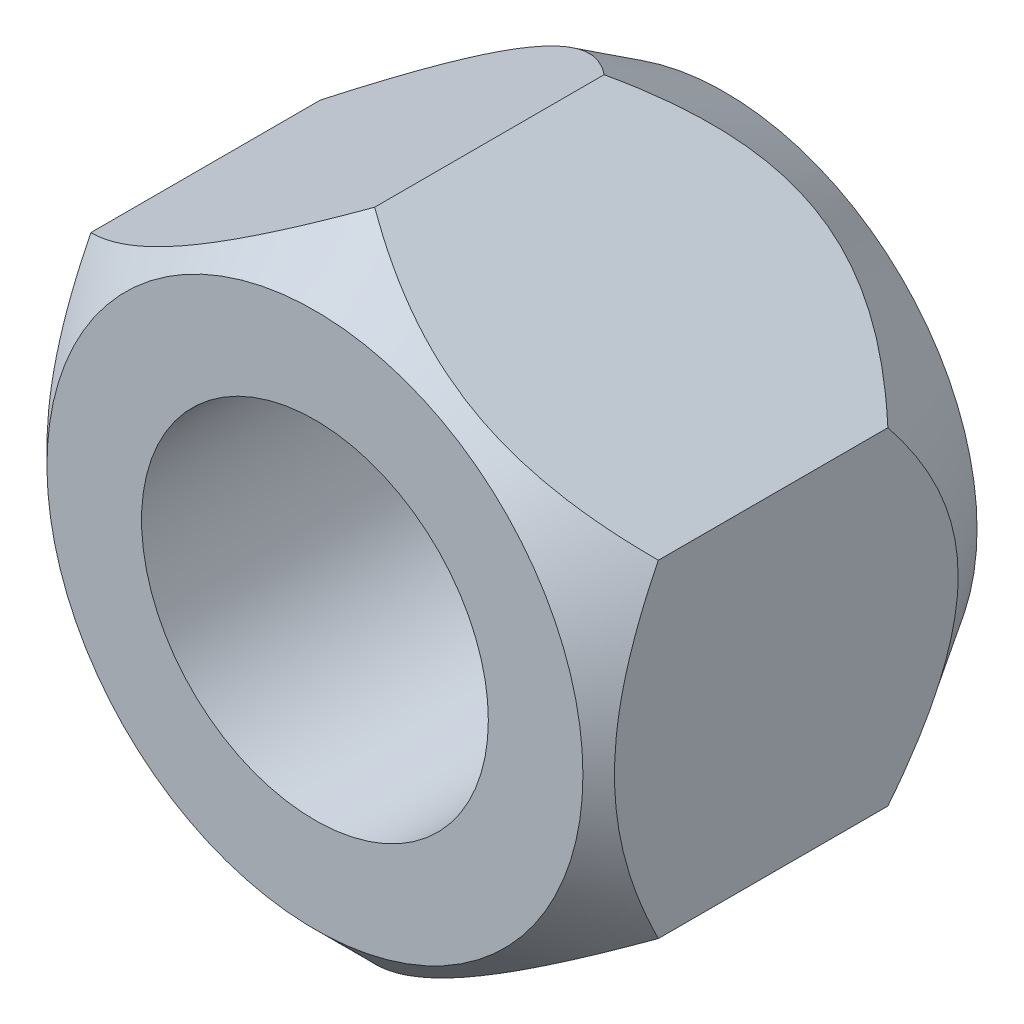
ISO-10303-21;
HEADER;
FILE_DESCRIPTION(('STEP AP214'),'2;1');
FILE_NAME('part.step','',(''),(''),'','','');
FILE_SCHEMA(('AUTOMOTIVE_DESIGN { 1 0 10303 214 1 1 1 1 }'));
ENDSEC;
DATA;
#1=APPLICATION_CONTEXT('core data for automotive mechanical design processes');
#2=APPLICATION_PROTOCOL_DEFINITION('international standard','automotive_design',2000,#1);
#3=PRODUCT_CONTEXT('',#1,'mechanical');
#4=PRODUCT('Part','Part','',(#3));
#5=PRODUCT_RELATED_PRODUCT_CATEGORY('part','',(#4));
#6=PRODUCT_DEFINITION_FORMATION('','',#4);
#7=PRODUCT_DEFINITION_CONTEXT('part definition',#1,'design');
#8=PRODUCT_DEFINITION('design','',#6,#7);
#9=PRODUCT_DEFINITION_SHAPE('','',#8);
#10=(LENGTH_UNIT() NAMED_UNIT(*) SI_UNIT(.MILLI.,.METRE.));
#11=(NAMED_UNIT(*) PLANE_ANGLE_UNIT() SI_UNIT($,.RADIAN.));
#12=(NAMED_UNIT(*) SI_UNIT($,.STERADIAN.) SOLID_ANGLE_UNIT());
#13=UNCERTAINTY_MEASURE_WITH_UNIT(LENGTH_MEASURE(1.E-05),#10,'distance_accuracy_value','');
#14=(GEOMETRIC_REPRESENTATION_CONTEXT(3) GLOBAL_UNCERTAINTY_ASSIGNED_CONTEXT((#13)) GLOBAL_UNIT_ASSIGNED_CONTEXT((#10,
#11,#12)) REPRESENTATION_CONTEXT('',''));
#15=CARTESIAN_POINT('',(0.,0.,0.));
#16=DIRECTION('',(0.,0.,1.));
#17=DIRECTION('',(1.,0.,0.));
#18=AXIS2_PLACEMENT_3D('',#15,#16,#17);
#19=CARTESIAN_POINT('',(14.2875,8.24889197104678,10.31875));
#20=DIRECTION('',(-0.5,-0.866025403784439,0.));
#21=DIRECTION('',(0.866025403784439,-0.5,0.));
#22=AXIS2_PLACEMENT_3D('',#19,#20,#21);
#23=PLANE('',#22);
#24=CARTESIAN_POINT('',(-0.000200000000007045,16.4978994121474,-4.24084043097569));
#25=CARTESIAN_POINT('',(0.151351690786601,16.4104010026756,-4.38085365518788));
#26=CARTESIAN_POINT('',(0.304311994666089,16.3220893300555,-4.51885879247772));
#27=CARTESIAN_POINT('',(0.613313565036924,16.1436871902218,-4.79028596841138));
#28=CARTESIAN_POINT('',(0.76935563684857,16.0535962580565,-4.92370678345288));
#29=CARTESIAN_POINT('',(1.08541181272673,15.8711211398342,-5.18591043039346));
#30=CARTESIAN_POINT('',(1.24544059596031,15.7787284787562,-5.31466976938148));
#31=CARTESIAN_POINT('',(1.56899301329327,15.591925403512,-5.56615071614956));
#32=CARTESIAN_POINT('',(1.73251640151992,15.4975151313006,-5.68887274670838));
#33=CARTESIAN_POINT('',(2.23620299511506,15.2067115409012,-6.05219770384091));
#34=CARTESIAN_POINT('',(2.58235289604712,15.0068618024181,-6.28194521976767));
#35=CARTESIAN_POINT('',(3.29110558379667,14.5976632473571,-6.70348963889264));
#36=CARTESIAN_POINT('',(3.65367645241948,14.3883328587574,-6.89535658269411));
#37=CARTESIAN_POINT('',(4.24558100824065,14.0465966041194,-7.16272775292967));
#38=CARTESIAN_POINT('',(4.46960670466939,13.9172553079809,-7.25393681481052));
#39=CARTESIAN_POINT('',(4.92306826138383,13.6554491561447,-7.41652738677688));
#40=CARTESIAN_POINT('',(5.15250440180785,13.5229841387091,-7.4879078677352));
#41=CARTESIAN_POINT('',(5.61393185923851,13.25657887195,-7.6079560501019));
#42=CARTESIAN_POINT('',(5.84588884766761,13.12265844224,-7.65679811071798));
#43=CARTESIAN_POINT('',(6.31264174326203,12.8531785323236,-7.73072377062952));
#44=CARTESIAN_POINT('',(6.54743746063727,12.7176191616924,-7.75580894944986));
#45=CARTESIAN_POINT('',(7.01974733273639,12.444930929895,-7.78126094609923));
#46=CARTESIAN_POINT('',(7.25726886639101,12.3077978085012,-7.78144766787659));
#47=CARTESIAN_POINT('',(7.73131390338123,12.0341077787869,-7.75664237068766));
#48=CARTESIAN_POINT('',(7.96783739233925,11.8975508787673,-7.7316499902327));
#49=CARTESIAN_POINT('',(8.43872969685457,11.6256810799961,-7.65743673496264));
#50=CARTESIAN_POINT('',(8.67308963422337,11.4903733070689,-7.60814148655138));
#51=CARTESIAN_POINT('',(9.13741984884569,11.2222921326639,-7.48721567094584));
#52=CARTESIAN_POINT('',(9.36738953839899,11.0895190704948,-7.41558213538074));
#53=CARTESIAN_POINT('',(9.90800778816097,10.7773929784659,-7.22146480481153));
#54=CARTESIAN_POINT('',(10.2162382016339,10.5994360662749,-7.08999689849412));
#55=CARTESIAN_POINT('',(10.8212891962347,10.2501097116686,-6.79580094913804));
#56=CARTESIAN_POINT('',(11.118103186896,10.0787440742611,-6.63305516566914));
#57=CARTESIAN_POINT('',(11.7009633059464,9.74222962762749,-6.28203206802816));
#58=CARTESIAN_POINT('',(11.9869821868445,9.57709654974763,-6.09369503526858));
#59=CARTESIAN_POINT('',(12.5481725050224,9.25309316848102,-5.69693120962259));
#60=CARTESIAN_POINT('',(12.823346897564,9.094221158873,-5.48850994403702));
#61=CARTESIAN_POINT('',(13.2984879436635,8.81989834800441,-5.10801060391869));
#62=CARTESIAN_POINT('',(13.5005302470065,8.70324916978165,-4.93935382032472));
#63=CARTESIAN_POINT('',(13.8983590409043,8.47356260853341,-4.59513040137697));
#64=CARTESIAN_POINT('',(14.0941746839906,8.36050839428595,-4.41960876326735));
#65=CARTESIAN_POINT('',(14.2877,8.24877650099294,-4.24084043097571));
#66=B_SPLINE_CURVE_WITH_KNOTS('',3,(#24,#25,#26,#27,#28,#29,#30,#31,#32,#33,#34,#35,#36,#37,#38,
#39,#40,#41,#42,#43,#44,#45,#46,#47,#48,#49,#50,#51,#52,#53,#54,#55,#56,#57,#58,#59,#60,#61,#62,
#63,#64,#65),.UNSPECIFIED.,.F.,.F.,(4,2,2,2,2,2,2,2,2,2,2,2,2,2,2,2,2,2,2,2,4),(0.,
0.672352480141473,1.3448830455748,2.02043080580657,2.69593119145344,4.07745335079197,
5.45639666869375,6.27860586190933,7.1008577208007,7.9166372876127,8.73236261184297,
9.55398794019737,10.3756250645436,11.1997923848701,12.0240692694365,13.1604154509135,
14.2974080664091,15.4371010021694,16.5764811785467,17.4399485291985,18.298481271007),.UNSPECIFIED.);
#67=CARTESIAN_POINT('',(0.,16.4977839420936,-4.24102522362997));
#68=VERTEX_POINT('',#67);
#69=CARTESIAN_POINT('',(14.2875,8.24889197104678,-4.24102522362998));
#70=VERTEX_POINT('',#69);
#71=EDGE_CURVE('E47',#68,#70,#66,.T.);
#72=ORIENTED_EDGE('',*,*,#71,.F.);
#73=DIRECTION('',(0.,0.,-1.));
#74=VECTOR('',#73,1.);
#75=CARTESIAN_POINT('',(0.,16.4977839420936,10.31875));
#76=LINE('',#75,#74);
#77=CARTESIAN_POINT('',(0.,16.4977839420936,7.31471605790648));
#78=VERTEX_POINT('',#77);
#79=EDGE_CURVE('E11',#78,#68,#76,.T.);
#80=ORIENTED_EDGE('',*,*,#79,.F.);
#81=CARTESIAN_POINT('',(14.2877,8.24877650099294,7.31460058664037));
#82=CARTESIAN_POINT('',(14.0420676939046,8.39059237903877,7.45639496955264));
#83=CARTESIAN_POINT('',(13.7945116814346,8.53351890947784,7.59386250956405));
#84=CARTESIAN_POINT('',(13.2952528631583,8.82176612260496,7.85876951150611));
#85=CARTESIAN_POINT('',(13.043547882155,8.96708806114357,7.98620349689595));
#86=CARTESIAN_POINT('',(12.5345045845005,9.26098434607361,8.23020866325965));
#87=CARTESIAN_POINT('',(12.2771422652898,9.40957255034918,8.34671347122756));
#88=CARTESIAN_POINT('',(11.758190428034,9.70918953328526,8.56632987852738));
#89=CARTESIAN_POINT('',(11.4966015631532,9.86021793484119,8.66944352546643));
#90=CARTESIAN_POINT('',(10.9734032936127,10.1622865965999,8.85901539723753));
#91=CARTESIAN_POINT('',(10.7118581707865,10.3132897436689,8.94570884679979));
#92=CARTESIAN_POINT('',(10.185099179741,10.617414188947,9.10265859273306));
#93=CARTESIAN_POINT('',(9.91988570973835,10.7705352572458,9.17291665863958));
#94=CARTESIAN_POINT('',(9.38693581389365,11.0782340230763,9.29523035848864));
#95=CARTESIAN_POINT('',(9.11920648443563,11.2328076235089,9.34732696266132));
#96=CARTESIAN_POINT('',(8.58146662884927,11.5432718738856,9.43215993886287));
#97=CARTESIAN_POINT('',(8.31145644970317,11.6991623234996,9.46489920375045));
#98=CARTESIAN_POINT('',(7.84717359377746,11.9672161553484,9.5036707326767));
#99=CARTESIAN_POINT('',(7.65320173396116,12.0792058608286,9.51465053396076));
#100=CARTESIAN_POINT('',(7.26500788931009,12.3033296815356,9.5260702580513));
#101=CARTESIAN_POINT('',(7.07078589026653,12.415463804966,9.52650955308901));
#102=CARTESIAN_POINT('',(6.6824881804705,12.6396475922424,9.51683278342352));
#103=CARTESIAN_POINT('',(6.48841252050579,12.7516972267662,9.50671399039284));
#104=CARTESIAN_POINT('',(6.10087023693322,12.9754448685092,9.47608147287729));
#105=CARTESIAN_POINT('',(5.9074036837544,13.0871428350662,9.45556658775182));
#106=CARTESIAN_POINT('',(5.32814383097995,13.4215786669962,9.37879158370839));
#107=CARTESIAN_POINT('',(4.9437998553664,13.6434797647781,9.30730955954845));
#108=CARTESIAN_POINT('',(4.18178074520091,14.0834317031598,9.12766062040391));
#109=CARTESIAN_POINT('',(3.80410510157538,14.3014828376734,9.01949651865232));
#110=CARTESIAN_POINT('',(3.1336727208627,14.6885571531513,8.79698133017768));
#111=CARTESIAN_POINT('',(2.8394343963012,14.8584357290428,8.68848379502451));
#112=CARTESIAN_POINT('',(2.25624233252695,15.1951418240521,8.45400572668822));
#113=CARTESIAN_POINT('',(1.96728875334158,15.3619692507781,8.32802466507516));
#114=CARTESIAN_POINT('',(1.39557236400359,15.6920498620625,8.06140366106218));
#115=CARTESIAN_POINT('',(1.11279329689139,15.8553124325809,7.92080982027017));
#116=CARTESIAN_POINT('',(0.552470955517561,16.178814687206,7.62680866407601));
#117=CARTESIAN_POINT('',(0.274924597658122,16.3390561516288,7.47340920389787));
#118=CARTESIAN_POINT('',(-0.000200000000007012,16.4978994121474,7.31460058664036));
#119=B_SPLINE_CURVE_WITH_KNOTS('',3,(#81,#82,#83,#84,#85,#86,#87,#88,#89,#90,#91,#92,#93,#94,
#95,#96,#97,#98,#99,#100,#101,#102,#103,#104,#105,#106,#107,#108,#109,#110,#111,#112,#113,#114,
#115,#116,#117,#118),.UNSPECIFIED.,.F.,.F.,(4,2,2,2,2,2,2,2,2,2,2,2,2,2,2,2,2,2,4),(0.,
0.951341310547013,1.90319833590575,2.86050526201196,3.8176656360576,4.75985912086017,
5.70195111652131,6.64190389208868,7.58171616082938,8.25423094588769,8.92678578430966,
9.59951446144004,10.2723182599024,11.6189942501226,12.9655669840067,14.0350382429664,
15.1045418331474,16.1707681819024,17.236345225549),.UNSPECIFIED.);
#120=CARTESIAN_POINT('',(14.2875,8.24889197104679,7.31471605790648));
#121=VERTEX_POINT('',#120);
#122=EDGE_CURVE('E103',#121,#78,#119,.T.);
#123=ORIENTED_EDGE('',*,*,#122,.F.);
#124=DIRECTION('',(0.,0.,-1.));
#125=VECTOR('',#124,1.);
#126=CARTESIAN_POINT('',(14.2875,8.24889197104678,10.31875));
#127=LINE('',#126,#125);
#128=EDGE_CURVE('E96',#121,#70,#127,.T.);
#129=ORIENTED_EDGE('',*,*,#128,.T.);
#130=EDGE_LOOP('',(#72,#80,#123,#129));
#131=FACE_BOUND('',#130,.T.);
#132=ADVANCED_FACE('F31',(#131),#23,.F.);
#133=CARTESIAN_POINT('',(0.,16.4977839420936,10.31875));
#134=DIRECTION('',(0.5,-0.866025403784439,0.));
#135=DIRECTION('',(0.866025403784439,0.5,0.));
#136=AXIS2_PLACEMENT_3D('',#133,#134,#135);
#137=PLANE('',#136);
#138=CARTESIAN_POINT('',(-14.2877,8.24877650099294,-4.24084043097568));
#139=CARTESIAN_POINT('',(-14.1361483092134,8.33627491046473,-4.38085365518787));
#140=CARTESIAN_POINT('',(-13.9831880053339,8.42458658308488,-4.51885879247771));
#141=CARTESIAN_POINT('',(-13.6741864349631,8.6029887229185,-4.79028596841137));
#142=CARTESIAN_POINT('',(-13.5181443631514,8.69307965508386,-4.92370678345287));
#143=CARTESIAN_POINT('',(-13.2020881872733,8.87555477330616,-5.18591043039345));
#144=CARTESIAN_POINT('',(-13.0420594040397,8.96794743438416,-5.31466976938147));
#145=CARTESIAN_POINT('',(-12.7185069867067,9.15475050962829,-5.56615071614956));
#146=CARTESIAN_POINT('',(-12.5549835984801,9.24916078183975,-5.68887274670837));
#147=CARTESIAN_POINT('',(-12.0512970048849,9.53996437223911,-6.05219770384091));
#148=CARTESIAN_POINT('',(-11.7051471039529,9.7398141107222,-6.28194521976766));
#149=CARTESIAN_POINT('',(-10.9963944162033,10.1490126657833,-6.70348963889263));
#150=CARTESIAN_POINT('',(-10.6338235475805,10.358343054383,-6.8953565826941));
#151=CARTESIAN_POINT('',(-10.0419189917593,10.7000793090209,-7.16272775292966));
#152=CARTESIAN_POINT('',(-9.81789329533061,10.8294206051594,-7.25393681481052));
#153=CARTESIAN_POINT('',(-9.36443173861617,11.0912267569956,-7.41652738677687));
#154=CARTESIAN_POINT('',(-9.13499559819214,11.2236917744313,-7.48790786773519));
#155=CARTESIAN_POINT('',(-8.67356814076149,11.4900970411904,-7.60795605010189));
#156=CARTESIAN_POINT('',(-8.44161115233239,11.6240174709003,-7.65679811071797));
#157=CARTESIAN_POINT('',(-7.97485825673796,11.8934973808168,-7.73072377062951));
#158=CARTESIAN_POINT('',(-7.74006253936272,12.0290567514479,-7.75580894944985));
#159=CARTESIAN_POINT('',(-7.26775266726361,12.3017449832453,-7.78126094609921));
#160=CARTESIAN_POINT('',(-7.03023113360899,12.4388781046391,-7.78144766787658));
#161=CARTESIAN_POINT('',(-6.55618609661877,12.7125681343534,-7.75664237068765));
#162=CARTESIAN_POINT('',(-6.31966260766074,12.849125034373,-7.73164999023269));
#163=CARTESIAN_POINT('',(-5.84877030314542,13.1209948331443,-7.65743673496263));
#164=CARTESIAN_POINT('',(-5.61441036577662,13.2563026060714,-7.60814148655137));
#165=CARTESIAN_POINT('',(-5.1500801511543,13.5243837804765,-7.48721567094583));
#166=CARTESIAN_POINT('',(-4.920110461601,13.6571568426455,-7.41558213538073));
#167=CARTESIAN_POINT('',(-4.37949221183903,13.9692829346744,-7.22146480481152));
#168=CARTESIAN_POINT('',(-4.0712617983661,14.1472398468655,-7.08999689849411));
#169=CARTESIAN_POINT('',(-3.46621080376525,14.4965662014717,-6.79580094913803));
#170=CARTESIAN_POINT('',(-3.16939681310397,14.6679318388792,-6.63305516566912));
#171=CARTESIAN_POINT('',(-2.58653669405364,15.0044462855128,-6.28203206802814));
#172=CARTESIAN_POINT('',(-2.30051781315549,15.1695793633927,-6.09369503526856));
#173=CARTESIAN_POINT('',(-1.7393274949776,15.4935827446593,-5.69693120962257));
#174=CARTESIAN_POINT('',(-1.46415310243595,15.6524547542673,-5.48850994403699));
#175=CARTESIAN_POINT('',(-0.989012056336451,15.9267775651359,-5.10801060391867));
#176=CARTESIAN_POINT('',(-0.786969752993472,16.0434267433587,-4.9393538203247));
#177=CARTESIAN_POINT('',(-0.389140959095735,16.2731133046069,-4.59513040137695));
#178=CARTESIAN_POINT('',(-0.193325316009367,16.3861675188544,-4.41960876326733));
#179=CARTESIAN_POINT('',(0.000199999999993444,16.4978994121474,-4.2408404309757));
#180=B_SPLINE_CURVE_WITH_KNOTS('',3,(#138,#139,#140,#141,#142,#143,#144,#145,#146,#147,#148,
#149,#150,#151,#152,#153,#154,#155,#156,#157,#158,#159,#160,#161,#162,#163,#164,#165,#166,#167,
#168,#169,#170,#171,#172,#173,#174,#175,#176,#177,#178,#179),.UNSPECIFIED.,.F.,.F.,(4,2,2,2,2,2,
2,2,2,2,2,2,2,2,2,2,2,2,2,2,4),(0.,0.672352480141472,1.3448830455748,2.02043080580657,
2.69593119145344,4.07745335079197,5.45639666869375,6.27860586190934,7.1008577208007,
7.91663728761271,8.73236261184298,9.55398794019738,10.3756250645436,11.1997923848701,
12.0240692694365,13.1604154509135,14.2974080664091,15.4371010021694,16.5764811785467,
17.4399485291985,18.298481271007),.UNSPECIFIED.);
#181=CARTESIAN_POINT('',(-14.2875,8.24889197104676,-4.24102522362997));
#182=VERTEX_POINT('',#181);
#183=EDGE_CURVE('E83',#182,#68,#180,.T.);
#184=ORIENTED_EDGE('',*,*,#183,.F.);
#185=DIRECTION('',(0.,0.,-1.));
#186=VECTOR('',#185,1.);
#187=CARTESIAN_POINT('',(-14.2875,8.24889197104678,10.31875));
#188=LINE('',#187,#186);
#189=CARTESIAN_POINT('',(-14.2875,8.24889197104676,7.31471605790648));
#190=VERTEX_POINT('',#189);
#191=EDGE_CURVE('E40',#190,#182,#188,.T.);
#192=ORIENTED_EDGE('',*,*,#191,.F.);
#193=CARTESIAN_POINT('',(0.000199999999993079,16.4978994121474,7.31460058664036));
#194=CARTESIAN_POINT('',(-0.24543230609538,16.3560835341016,7.45639496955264));
#195=CARTESIAN_POINT('',(-0.492988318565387,16.2131570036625,7.59386250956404));
#196=CARTESIAN_POINT('',(-0.992247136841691,15.9249097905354,7.8587695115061));
#197=CARTESIAN_POINT('',(-1.24395211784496,15.7795878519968,7.98620349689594));
#198=CARTESIAN_POINT('',(-1.75299541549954,15.4856915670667,8.23020866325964));
#199=CARTESIAN_POINT('',(-2.01035773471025,15.3371033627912,8.34671347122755));
#200=CARTESIAN_POINT('',(-2.52930957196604,15.0374863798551,8.56632987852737));
#201=CARTESIAN_POINT('',(-2.79089843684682,14.8864579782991,8.66944352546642));
#202=CARTESIAN_POINT('',(-3.31409670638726,14.5843893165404,8.85901539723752));
#203=CARTESIAN_POINT('',(-3.57564182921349,14.4333861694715,8.94570884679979));
#204=CARTESIAN_POINT('',(-4.10240082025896,14.1292617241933,9.10265859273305));
#205=CARTESIAN_POINT('',(-4.36761429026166,13.9761406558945,9.17291665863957));
#206=CARTESIAN_POINT('',(-4.90056418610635,13.668441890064,9.29523035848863));
#207=CARTESIAN_POINT('',(-5.16829351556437,13.5138682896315,9.34732696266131));
#208=CARTESIAN_POINT('',(-5.70603337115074,13.2034040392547,9.43215993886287));
#209=CARTESIAN_POINT('',(-5.97604355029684,13.0475135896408,9.46489920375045));
#210=CARTESIAN_POINT('',(-6.44032640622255,12.7794597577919,9.5036707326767));
#211=CARTESIAN_POINT('',(-6.63429826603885,12.6674700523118,9.51465053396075));
#212=CARTESIAN_POINT('',(-7.02249211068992,12.4433462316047,9.52607025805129));
#213=CARTESIAN_POINT('',(-7.21671410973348,12.3312121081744,9.52650955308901));
#214=CARTESIAN_POINT('',(-7.6050118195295,12.1070283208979,9.51683278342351));
#215=CARTESIAN_POINT('',(-7.79908747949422,11.9949786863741,9.50671399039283));
#216=CARTESIAN_POINT('',(-8.18662976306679,11.7712310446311,9.47608147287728));
#217=CARTESIAN_POINT('',(-8.38009631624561,11.6595330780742,9.45556658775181));
#218=CARTESIAN_POINT('',(-8.95935616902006,11.3250972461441,9.37879158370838));
#219=CARTESIAN_POINT('',(-9.34370014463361,11.1031961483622,9.30730955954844));
#220=CARTESIAN_POINT('',(-10.1057192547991,10.6632442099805,9.1276606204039));
#221=CARTESIAN_POINT('',(-10.4833948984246,10.4451930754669,9.01949651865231));
#222=CARTESIAN_POINT('',(-11.1538272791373,10.058118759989,8.79698133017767));
#223=CARTESIAN_POINT('',(-11.4480656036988,9.88824018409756,8.6884837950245));
#224=CARTESIAN_POINT('',(-12.0312576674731,9.55153408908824,8.45400572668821));
#225=CARTESIAN_POINT('',(-12.3202112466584,9.38470666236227,8.32802466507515));
#226=CARTESIAN_POINT('',(-12.8919276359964,9.05462605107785,8.06140366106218));
#227=CARTESIAN_POINT('',(-13.1747067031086,8.89136348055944,7.92080982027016));
#228=CARTESIAN_POINT('',(-13.7350290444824,8.56786122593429,7.62680866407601));
#229=CARTESIAN_POINT('',(-14.0125754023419,8.40761976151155,7.47340920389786));
#230=CARTESIAN_POINT('',(-14.2877,8.24877650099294,7.31460058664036));
#231=B_SPLINE_CURVE_WITH_KNOTS('',3,(#193,#194,#195,#196,#197,#198,#199,#200,#201,#202,#203,
#204,#205,#206,#207,#208,#209,#210,#211,#212,#213,#214,#215,#216,#217,#218,#219,#220,#221,#222,
#223,#224,#225,#226,#227,#228,#229,#230),.UNSPECIFIED.,.F.,.F.,(4,2,2,2,2,2,2,2,2,2,2,2,2,2,2,2,
2,2,4),(0.,0.951341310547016,1.90319833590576,2.86050526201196,3.8176656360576,4.75985912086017,
5.70195111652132,6.64190389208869,7.58171616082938,8.2542309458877,8.92678578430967,
9.59951446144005,10.2723182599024,11.6189942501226,12.9655669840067,14.0350382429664,
15.1045418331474,16.1707681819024,17.236345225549),.UNSPECIFIED.);
#232=EDGE_CURVE('E101',#78,#190,#231,.T.);
#233=ORIENTED_EDGE('',*,*,#232,.F.);
#234=ORIENTED_EDGE('',*,*,#79,.T.);
#235=EDGE_LOOP('',(#184,#192,#233,#234));
#236=FACE_BOUND('',#235,.T.);
#237=ADVANCED_FACE('F100',(#236),#137,.F.);
#238=CARTESIAN_POINT('',(-14.2875,8.24889197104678,10.31875));
#239=DIRECTION('',(1.,0.,0.));
#240=DIRECTION('',(0.,0.,-1.));
#241=AXIS2_PLACEMENT_3D('',#238,#239,#240);
#242=PLANE('',#241);
#243=CARTESIAN_POINT('',(-14.2875,-34.0456741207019,28.4446937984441));
#244=CARTESIAN_POINT('',(-14.2875,-33.6715713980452,27.8926495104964));
#245=CARTESIAN_POINT('',(-14.2875,-33.296840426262,27.341031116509));
#246=CARTESIAN_POINT('',(-14.2875,-32.5459857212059,26.238741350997));
#247=CARTESIAN_POINT('',(-14.2875,-32.1698619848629,25.6880699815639));
#248=CARTESIAN_POINT('',(-14.2875,-31.0391512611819,24.0375521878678));
#249=CARTESIAN_POINT('',(-14.2875,-30.2822728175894,22.9392730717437));
#250=CARTESIAN_POINT('',(-14.2875,-28.7585169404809,20.744299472));
#251=CARTESIAN_POINT('',(-14.2875,-27.9916147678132,19.6476221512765));
#252=CARTESIAN_POINT('',(-14.2875,-26.4484398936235,17.4609315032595));
#253=CARTESIAN_POINT('',(-14.2875,-25.6721675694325,16.3709179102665));
#254=CARTESIAN_POINT('',(-14.2875,-24.4597135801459,14.6881429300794));
#255=CARTESIAN_POINT('',(-14.2875,-24.0277065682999,14.0923731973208));
#256=CARTESIAN_POINT('',(-14.2875,-23.1595090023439,12.903891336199));
#257=CARTESIAN_POINT('',(-14.2875,-22.723318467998,12.3111791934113));
#258=CARTESIAN_POINT('',(-14.2875,-21.8460235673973,11.1292686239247));
#259=CARTESIAN_POINT('',(-14.2875,-21.4049185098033,10.5400707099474));
#260=CARTESIAN_POINT('',(-14.2875,-20.517033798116,9.3659659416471));
#261=CARTESIAN_POINT('',(-14.2875,-20.0702541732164,8.78105906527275));
#262=CARTESIAN_POINT('',(-14.2875,-19.1707898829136,7.61744416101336));
#263=CARTESIAN_POINT('',(-14.2875,-18.7181170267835,7.03872701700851));
#264=CARTESIAN_POINT('',(-14.2875,-17.804805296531,5.88757786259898));
#265=CARTESIAN_POINT('',(-14.2875,-17.3441662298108,5.31514600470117));
#266=CARTESIAN_POINT('',(-14.2875,-16.4134193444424,4.17825756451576));
#267=CARTESIAN_POINT('',(-14.2875,-15.9433139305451,3.61379901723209));
#268=CARTESIAN_POINT('',(-14.2875,-14.9914505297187,2.49481661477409));
#269=CARTESIAN_POINT('',(-14.2875,-14.5096933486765,1.94029207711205));
#270=CARTESIAN_POINT('',(-14.2875,-13.7007029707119,1.03351674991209));
#271=CARTESIAN_POINT('',(-14.2875,-13.377598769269,0.677583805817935));
#272=CARTESIAN_POINT('',(-14.2875,-12.7241960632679,-0.027650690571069));
#273=CARTESIAN_POINT('',(-14.2875,-12.3938973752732,-0.376952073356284));
#274=CARTESIAN_POINT('',(-14.2875,-11.7244139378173,-1.06801161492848));
#275=CARTESIAN_POINT('',(-14.2875,-11.3852161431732,-1.4097571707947));
#276=CARTESIAN_POINT('',(-14.2875,-10.6970015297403,-2.08322179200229));
#277=CARTESIAN_POINT('',(-14.2875,-10.3479851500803,-2.41494130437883));
#278=CARTESIAN_POINT('',(-14.2875,-9.64405105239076,-3.06061675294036));
#279=CARTESIAN_POINT('',(-14.2875,-9.28931684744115,-3.37477187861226));
#280=CARTESIAN_POINT('',(-14.2875,-8.56657950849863,-3.98770065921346));
#281=CARTESIAN_POINT('',(-14.2875,-8.19857341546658,-4.28647084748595));
#282=CARTESIAN_POINT('',(-14.2875,-7.44805821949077,-4.86329683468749));
#283=CARTESIAN_POINT('',(-14.2875,-7.06558856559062,-5.1414035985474));
#284=CARTESIAN_POINT('',(-14.2875,-6.28304466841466,-5.67143689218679));
#285=CARTESIAN_POINT('',(-14.2875,-5.88298223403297,-5.92338061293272));
#286=CARTESIAN_POINT('',(-14.2875,-5.19346338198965,-6.31808614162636));
#287=CARTESIAN_POINT('',(-14.2875,-4.90931986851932,-6.47007969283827));
#288=CARTESIAN_POINT('',(-14.2875,-4.47593023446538,-6.68348816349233));
#289=CARTESIAN_POINT('',(-14.2875,-4.33026447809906,-6.75219681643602));
#290=CARTESIAN_POINT('',(-14.2875,-4.03647962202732,-6.88431241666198));
#291=CARTESIAN_POINT('',(-14.2875,-3.88835954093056,-6.94771717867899));
#292=CARTESIAN_POINT('',(-14.2875,-3.44131997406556,-7.12883850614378));
#293=CARTESIAN_POINT('',(-14.2875,-3.13881855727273,-7.23791244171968));
#294=CARTESIAN_POINT('',(-14.2875,-2.52538864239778,-7.42877494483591));
#295=CARTESIAN_POINT('',(-14.2875,-2.21446435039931,-7.51057686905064));
#296=CARTESIAN_POINT('',(-14.2875,-1.64666945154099,-7.63038003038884));
#297=CARTESIAN_POINT('',(-14.2875,-1.39093971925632,-7.67378620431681));
#298=CARTESIAN_POINT('',(-14.2875,-0.876726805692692,-7.73888084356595));
#299=CARTESIAN_POINT('',(-14.2875,-0.618243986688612,-7.76057213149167));
#300=CARTESIAN_POINT('',(-14.2875,-0.100294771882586,-7.78141046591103));
#301=CARTESIAN_POINT('',(-14.2875,0.159171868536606,-7.7805514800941));
#302=CARTESIAN_POINT('',(-14.2875,0.677053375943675,-7.75630930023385));
#303=CARTESIAN_POINT('',(-14.2875,0.93546818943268,-7.73292497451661));
#304=CARTESIAN_POINT('',(-14.2875,1.448299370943,-7.6646696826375));
#305=CARTESIAN_POINT('',(-14.2875,1.70272804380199,-7.61989020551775));
#306=CARTESIAN_POINT('',(-14.2875,2.20723019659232,-7.51043926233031));
#307=CARTESIAN_POINT('',(-14.2875,2.45730365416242,-7.44576769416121));
#308=CARTESIAN_POINT('',(-14.2875,2.9521503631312,-7.29847257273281));
#309=CARTESIAN_POINT('',(-14.2875,3.19692194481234,-7.21584345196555));
#310=CARTESIAN_POINT('',(-14.2875,3.68050653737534,-7.03475502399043));
#311=CARTESIAN_POINT('',(-14.2875,3.91931893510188,-6.93629409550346));
#312=CARTESIAN_POINT('',(-14.2875,4.59810113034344,-6.6329617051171));
#313=CARTESIAN_POINT('',(-14.2875,5.03030566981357,-6.4106505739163));
#314=CARTESIAN_POINT('',(-14.2875,5.87387502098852,-5.92938813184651));
#315=CARTESIAN_POINT('',(-14.2875,6.28522001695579,-5.67040283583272));
#316=CARTESIAN_POINT('',(-14.2875,6.89033722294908,-5.25987244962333));
#317=CARTESIAN_POINT('',(-14.2875,7.09113467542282,-5.11851079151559));
#318=CARTESIAN_POINT('',(-14.2875,7.48828430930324,-4.82966041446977));
#319=CARTESIAN_POINT('',(-14.2875,7.6846364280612,-4.68217160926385));
#320=CARTESIAN_POINT('',(-14.2875,8.07310960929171,-4.3819601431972));
#321=CARTESIAN_POINT('',(-14.2875,8.26523297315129,-4.22924045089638));
#322=CARTESIAN_POINT('',(-14.2875,8.64567589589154,-3.91915615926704));
#323=CARTESIAN_POINT('',(-14.2875,8.83399555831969,-3.76179168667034));
#324=CARTESIAN_POINT('',(-14.2875,9.41355426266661,-3.26665725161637));
#325=CARTESIAN_POINT('',(-14.2875,9.79882284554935,-2.92188402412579));
#326=CARTESIAN_POINT('',(-14.2875,10.5564673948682,-2.21840038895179));
#327=CARTESIAN_POINT('',(-14.2875,10.9288404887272,-1.85968691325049));
#328=CARTESIAN_POINT('',(-14.2875,11.6629896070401,-1.13103224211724));
#329=CARTESIAN_POINT('',(-14.2875,12.024756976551,-0.761082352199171));
#330=CARTESIAN_POINT('',(-14.2875,12.7390473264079,-0.012445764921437));
#331=CARTESIAN_POINT('',(-14.2875,13.0915709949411,0.366240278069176));
#332=CARTESIAN_POINT('',(-14.2875,13.7902153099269,1.13231607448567));
#333=CARTESIAN_POINT('',(-14.2875,14.1363036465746,1.5197352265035));
#334=CARTESIAN_POINT('',(-14.2875,14.821720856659,2.30050664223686));
#335=CARTESIAN_POINT('',(-14.2875,15.1610496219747,2.69385900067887));
#336=CARTESIAN_POINT('',(-14.2875,15.8337295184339,3.48533870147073));
#337=CARTESIAN_POINT('',(-14.2875,16.1670831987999,3.88346388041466));
#338=CARTESIAN_POINT('',(-14.2875,16.8287347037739,4.68389699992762));
#339=CARTESIAN_POINT('',(-14.2875,17.1570324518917,5.08620500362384));
#340=CARTESIAN_POINT('',(-14.2875,18.0737729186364,6.2221883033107));
#341=CARTESIAN_POINT('',(-14.2875,18.6571963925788,6.95991527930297));
#342=CARTESIAN_POINT('',(-14.2875,19.8126513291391,8.44434593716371));
#343=CARTESIAN_POINT('',(-14.2875,20.3846814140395,9.19105068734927));
#344=CARTESIAN_POINT('',(-14.2875,21.5144659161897,10.6848320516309));
#345=CARTESIAN_POINT('',(-14.2875,22.0723018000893,11.4318471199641));
#346=CARTESIAN_POINT('',(-14.2875,22.9033887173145,12.5564330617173));
#347=CARTESIAN_POINT('',(-14.2875,23.1794465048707,12.9319353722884));
#348=CARTESIAN_POINT('',(-14.2875,23.729850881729,13.6841882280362));
#349=CARTESIAN_POINT('',(-14.2875,24.0041974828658,14.0609387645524));
#350=CARTESIAN_POINT('',(-14.2875,24.277769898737,14.4382509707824));
#351=B_SPLINE_CURVE_WITH_KNOTS('',3,(#243,#244,#245,#246,#247,#248,#249,#250,#251,#252,#253,
#254,#255,#256,#257,#258,#259,#260,#261,#262,#263,#264,#265,#266,#267,#268,#269,#270,#271,#272,
#273,#274,#275,#276,#277,#278,#279,#280,#281,#282,#283,#284,#285,#286,#287,#288,#289,#290,#291,
#292,#293,#294,#295,#296,#297,#298,#299,#300,#301,#302,#303,#304,#305,#306,#307,#308,#309,#310,
#311,#312,#313,#314,#315,#316,#317,#318,#319,#320,#321,#322,#323,#324,#325,#326,#327,#328,#329,
#330,#331,#332,#333,#334,#335,#336,#337,#338,#339,#340,#341,#342,#343,#344,#345,#346,#347,#348,
#349,#350),.UNSPECIFIED.,.F.,.F.,(4,2,2,2,2,2,2,2,2,2,2,2,2,2,2,2,2,2,2,2,2,2,2,2,2,2,2,2,2,2,2,
2,2,2,2,2,2,2,2,2,2,2,2,2,2,2,2,2,2,2,2,2,2,4),(0.,2.00058692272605,4.00117825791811,
8.00261811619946,12.0172506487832,16.0317220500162,18.2394540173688,20.4471755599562,
22.6552116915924,24.86323646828,27.0673655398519,29.2715479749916,31.4751773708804,
33.6786547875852,35.1207127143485,36.5628074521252,38.0071494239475,39.4514269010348,
40.8726176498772,42.2941272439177,43.7120056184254,45.1289463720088,46.0950075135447,
46.5780822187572,47.0613549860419,48.0248821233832,48.9879366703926,49.7652441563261,
50.5424505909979,51.3198649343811,52.0973183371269,52.8714765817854,53.6456388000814,
54.4200413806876,55.1945233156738,56.6500098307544,58.1068540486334,58.8434566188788,
59.5800695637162,60.3162711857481,61.0524527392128,62.6029885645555,64.1538675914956,
65.705978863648,67.257974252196,68.8163547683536,70.3747601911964,71.9324840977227,
73.490231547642,76.3117038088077,79.1335152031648,81.9304011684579,83.3285709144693,
84.726730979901),.UNSPECIFIED.);
#352=CARTESIAN_POINT('',(-14.2875,-8.2488919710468,-4.24102522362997));
#353=VERTEX_POINT('',#352);
#354=EDGE_CURVE('E86',#353,#182,#351,.T.);
#355=ORIENTED_EDGE('',*,*,#354,.F.);
#356=DIRECTION('',(0.,0.,-1.));
#357=VECTOR('',#356,1.);
#358=CARTESIAN_POINT('',(-14.2875,-8.24889197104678,10.31875));
#359=LINE('',#358,#357);
#360=CARTESIAN_POINT('',(-14.2875,-8.2488919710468,7.31471605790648));
#361=VERTEX_POINT('',#360);
#362=EDGE_CURVE('E199',#361,#353,#359,.T.);
#363=ORIENTED_EDGE('',*,*,#362,.F.);
#364=CARTESIAN_POINT('',(-14.2875,-16.8960061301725,1.68541977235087));
#365=CARTESIAN_POINT('',(-14.2875,-16.6912883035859,1.8417374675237));
#366=CARTESIAN_POINT('',(-14.2875,-16.4860022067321,1.9973103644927));
#367=CARTESIAN_POINT('',(-14.2875,-16.0741987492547,2.30682501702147));
#368=CARTESIAN_POINT('',(-14.2875,-15.8676813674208,2.46076674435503));
#369=CARTESIAN_POINT('',(-14.2875,-15.2460572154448,2.91999394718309));
#370=CARTESIAN_POINT('',(-14.2875,-14.8289708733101,3.22261066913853));
#371=CARTESIAN_POINT('',(-14.2875,-13.9854538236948,3.82158487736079));
#372=CARTESIAN_POINT('',(-14.2875,-13.558975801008,4.11787587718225));
#373=CARTESIAN_POINT('',(-14.2875,-12.6988622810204,4.69984792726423));
#374=CARTESIAN_POINT('',(-14.2875,-12.2652272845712,4.98552971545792));
#375=CARTESIAN_POINT('',(-14.2875,-11.3630096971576,5.56085411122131));
#376=CARTESIAN_POINT('',(-14.2875,-10.8939049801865,5.84968200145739));
#377=CARTESIAN_POINT('',(-14.2875,-9.94470233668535,6.40897552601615));
#378=CARTESIAN_POINT('',(-14.2875,-9.46460262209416,6.67943814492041));
#379=CARTESIAN_POINT('',(-14.2875,-8.49335388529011,7.19620889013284));
#380=CARTESIAN_POINT('',(-14.2875,-8.00224292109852,7.44258799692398));
#381=CARTESIAN_POINT('',(-14.2875,-7.00632883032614,7.9056734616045));
#382=CARTESIAN_POINT('',(-14.2875,-6.50153218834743,8.12239358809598));
#383=CARTESIAN_POINT('',(-14.2875,-5.52410205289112,8.50027380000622));
#384=CARTESIAN_POINT('',(-14.2875,-5.0527420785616,8.66470058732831));
#385=CARTESIAN_POINT('',(-14.2875,-4.09819514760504,8.95579513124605));
#386=CARTESIAN_POINT('',(-14.2875,-3.61500741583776,9.08246040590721));
#387=CARTESIAN_POINT('',(-14.2875,-2.88766646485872,9.23798734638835));
#388=CARTESIAN_POINT('',(-14.2875,-2.64707208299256,9.28380922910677));
#389=CARTESIAN_POINT('',(-14.2875,-2.16399432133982,9.36401035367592));
#390=CARTESIAN_POINT('',(-14.2875,-1.92151120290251,9.39839115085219));
#391=CARTESIAN_POINT('',(-14.2875,-1.43515835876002,9.4551324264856));
#392=CARTESIAN_POINT('',(-14.2875,-1.1912887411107,9.47749382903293));
#393=CARTESIAN_POINT('',(-14.2875,-0.7027253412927,9.50980524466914));
#394=CARTESIAN_POINT('',(-14.2875,-0.458031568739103,9.51975540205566));
#395=CARTESIAN_POINT('',(-14.2875,0.021622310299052,9.52691399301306));
#396=CARTESIAN_POINT('',(-14.2875,0.256575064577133,9.5246223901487));
#397=CARTESIAN_POINT('',(-14.2875,0.726107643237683,9.50848557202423));
#398=CARTESIAN_POINT('',(-14.2875,0.960687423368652,9.49463907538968));
#399=CARTESIAN_POINT('',(-14.2875,1.42888914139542,9.45562114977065));
#400=CARTESIAN_POINT('',(-14.2875,1.66251113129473,9.43045034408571));
#401=CARTESIAN_POINT('',(-14.2875,2.12833040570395,9.36919441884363));
#402=CARTESIAN_POINT('',(-14.2875,2.36052749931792,9.33310786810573));
#403=CARTESIAN_POINT('',(-14.2875,3.06249577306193,9.20779585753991));
#404=CARTESIAN_POINT('',(-14.2875,3.52942144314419,9.10222838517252));
#405=CARTESIAN_POINT('',(-14.2875,4.45295536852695,8.85378166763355));
#406=CARTESIAN_POINT('',(-14.2875,4.90956432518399,8.71090496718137));
#407=CARTESIAN_POINT('',(-14.2875,5.84414704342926,8.38260304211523));
#408=CARTESIAN_POINT('',(-14.2875,6.32129875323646,8.19485834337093));
#409=CARTESIAN_POINT('',(-14.2875,7.26327813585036,7.79042999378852));
#410=CARTESIAN_POINT('',(-14.2875,7.72810006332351,7.57373312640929));
#411=CARTESIAN_POINT('',(-14.2875,8.64765240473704,7.11654519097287));
#412=CARTESIAN_POINT('',(-14.2875,9.10234580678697,6.87598027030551));
#413=CARTESIAN_POINT('',(-14.2875,10.0012965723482,6.37635941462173));
#414=CARTESIAN_POINT('',(-14.2875,10.4455555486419,6.11730636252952));
#415=CARTESIAN_POINT('',(-14.2875,11.3032408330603,5.59752150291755));
#416=CARTESIAN_POINT('',(-14.2875,11.7171046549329,5.33750786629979));
#417=CARTESIAN_POINT('',(-14.2875,12.537724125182,4.80646567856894));
#418=CARTESIAN_POINT('',(-14.2875,12.9444792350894,4.53543629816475));
#419=CARTESIAN_POINT('',(-14.2875,13.7485275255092,3.9865302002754));
#420=CARTESIAN_POINT('',(-14.2875,14.1458705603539,3.70872633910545));
#421=CARTESIAN_POINT('',(-14.2875,14.7378393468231,3.28648032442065));
#422=CARTESIAN_POINT('',(-14.2875,14.9344630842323,3.14482675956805));
#423=CARTESIAN_POINT('',(-14.2875,15.3264642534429,2.85981345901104));
#424=CARTESIAN_POINT('',(-14.2875,15.5218417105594,2.71645375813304));
#425=CARTESIAN_POINT('',(-14.2875,15.7166424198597,2.5723139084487));
#426=B_SPLINE_CURVE_WITH_KNOTS('',3,(#364,#365,#366,#367,#368,#369,#370,#371,#372,#373,#374,
#375,#376,#377,#378,#379,#380,#381,#382,#383,#384,#385,#386,#387,#388,#389,#390,#391,#392,#393,
#394,#395,#396,#397,#398,#399,#400,#401,#402,#403,#404,#405,#406,#407,#408,#409,#410,#411,#412,
#413,#414,#415,#416,#417,#418,#419,#420,#421,#422,#423,#424,#425),.UNSPECIFIED.,.F.,.F.,(4,2,2,
2,2,2,2,2,2,2,2,2,2,2,2,2,2,2,2,2,2,2,2,2,2,2,2,2,2,2,4),(0.,0.772720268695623,1.54545388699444,
3.09127033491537,4.64903881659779,6.20669874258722,7.85903768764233,9.51164727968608,
11.1592292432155,12.8060437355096,14.3024440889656,15.7989427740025,16.533471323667,
17.267899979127,18.0022721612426,18.7366358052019,19.4412426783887,20.1459276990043,
20.8505739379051,21.555312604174,22.9894539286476,24.4234974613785,25.9605739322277,
27.4983544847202,29.0410511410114,30.5835077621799,32.0495942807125,33.515791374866,
34.9701631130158,35.6971629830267,36.4241480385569),.UNSPECIFIED.);
#427=EDGE_CURVE('E104',#190,#361,#426,.F.);
#428=ORIENTED_EDGE('',*,*,#427,.F.);
#429=ORIENTED_EDGE('',*,*,#191,.T.);
#430=EDGE_LOOP('',(#355,#363,#428,#429));
#431=FACE_BOUND('',#430,.T.);
#432=ADVANCED_FACE('F160',(#431),#242,.F.);
#433=CARTESIAN_POINT('',(-14.2875,-8.24889197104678,10.31875));
#434=DIRECTION('',(0.5,0.866025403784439,0.));
#435=DIRECTION('',(-0.866025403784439,0.5,0.));
#436=AXIS2_PLACEMENT_3D('',#433,#434,#435);
#437=PLANE('',#436);
#438=CARTESIAN_POINT('',(0.000199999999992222,-16.4978994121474,-4.24084043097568));
#439=CARTESIAN_POINT('',(-0.151351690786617,-16.4104010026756,-4.38085365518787));
#440=CARTESIAN_POINT('',(-0.304311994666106,-16.3220893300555,-4.51885879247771));
#441=CARTESIAN_POINT('',(-0.613313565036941,-16.1436871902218,-4.79028596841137));
#442=CARTESIAN_POINT('',(-0.769355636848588,-16.0535962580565,-4.92370678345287));
#443=CARTESIAN_POINT('',(-1.08541181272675,-15.8711211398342,-5.18591043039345));
#444=CARTESIAN_POINT('',(-1.24544059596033,-15.7787284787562,-5.31466976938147));
#445=CARTESIAN_POINT('',(-1.56899301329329,-15.591925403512,-5.56615071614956));
#446=CARTESIAN_POINT('',(-1.73251640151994,-15.4975151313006,-5.68887274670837));
#447=CARTESIAN_POINT('',(-2.23620299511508,-15.2067115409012,-6.0521977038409));
#448=CARTESIAN_POINT('',(-2.58235289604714,-15.0068618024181,-6.28194521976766));
#449=CARTESIAN_POINT('',(-3.29110558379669,-14.5976632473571,-6.70348963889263));
#450=CARTESIAN_POINT('',(-3.6536764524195,-14.3883328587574,-6.89535658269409));
#451=CARTESIAN_POINT('',(-4.24558100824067,-14.0465966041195,-7.16272775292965));
#452=CARTESIAN_POINT('',(-4.46960670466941,-13.9172553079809,-7.25393681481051));
#453=CARTESIAN_POINT('',(-4.92306826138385,-13.6554491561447,-7.41652738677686));
#454=CARTESIAN_POINT('',(-5.15250440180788,-13.5229841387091,-7.48790786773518));
#455=CARTESIAN_POINT('',(-5.61393185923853,-13.25657887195,-7.60795605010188));
#456=CARTESIAN_POINT('',(-5.84588884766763,-13.12265844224,-7.65679811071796));
#457=CARTESIAN_POINT('',(-6.31264174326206,-12.8531785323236,-7.7307237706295));
#458=CARTESIAN_POINT('',(-6.54743746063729,-12.7176191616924,-7.75580894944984));
#459=CARTESIAN_POINT('',(-7.01974733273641,-12.444930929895,-7.7812609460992));
#460=CARTESIAN_POINT('',(-7.25726886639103,-12.3077978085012,-7.78144766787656));
#461=CARTESIAN_POINT('',(-7.73131390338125,-12.0341077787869,-7.75664237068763));
#462=CARTESIAN_POINT('',(-7.96783739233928,-11.8975508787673,-7.73164999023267));
#463=CARTESIAN_POINT('',(-8.4387296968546,-11.6256810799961,-7.65743673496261));
#464=CARTESIAN_POINT('',(-8.67308963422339,-11.4903733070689,-7.60814148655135));
#465=CARTESIAN_POINT('',(-9.13741984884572,-11.2222921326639,-7.48721567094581));
#466=CARTESIAN_POINT('',(-9.36738953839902,-11.0895190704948,-7.41558213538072));
#467=CARTESIAN_POINT('',(-9.90800778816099,-10.7773929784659,-7.22146480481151));
#468=CARTESIAN_POINT('',(-10.2162382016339,-10.5994360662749,-7.08999689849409));
#469=CARTESIAN_POINT('',(-10.8212891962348,-10.2501097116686,-6.79580094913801));
#470=CARTESIAN_POINT('',(-11.118103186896,-10.0787440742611,-6.6330551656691));
#471=CARTESIAN_POINT('',(-11.7009633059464,-9.74222962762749,-6.28203206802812));
#472=CARTESIAN_POINT('',(-11.9869821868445,-9.57709654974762,-6.09369503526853));
#473=CARTESIAN_POINT('',(-12.5481725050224,-9.25309316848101,-5.69693120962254));
#474=CARTESIAN_POINT('',(-12.8233468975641,-9.094221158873,-5.48850994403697));
#475=CARTESIAN_POINT('',(-13.2984879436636,-8.81989834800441,-5.10801060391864));
#476=CARTESIAN_POINT('',(-13.5005302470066,-8.70324916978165,-4.93935382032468));
#477=CARTESIAN_POINT('',(-13.8983590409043,-8.47356260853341,-4.59513040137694));
#478=CARTESIAN_POINT('',(-14.0941746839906,-8.36050839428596,-4.41960876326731));
#479=CARTESIAN_POINT('',(-14.2877,-8.24877650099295,-4.24084043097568));
#480=B_SPLINE_CURVE_WITH_KNOTS('',3,(#438,#439,#440,#441,#442,#443,#444,#445,#446,#447,#448,
#449,#450,#451,#452,#453,#454,#455,#456,#457,#458,#459,#460,#461,#462,#463,#464,#465,#466,#467,
#468,#469,#470,#471,#472,#473,#474,#475,#476,#477,#478,#479),.UNSPECIFIED.,.F.,.F.,(4,2,2,2,2,2,
2,2,2,2,2,2,2,2,2,2,2,2,2,2,4),(0.,0.672352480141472,1.3448830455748,2.02043080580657,
2.69593119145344,4.07745335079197,5.45639666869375,6.27860586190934,7.1008577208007,
7.9166372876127,8.73236261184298,9.55398794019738,10.3756250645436,11.1997923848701,
12.0240692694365,13.1604154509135,14.2974080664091,15.4371010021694,16.5764811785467,
17.4399485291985,18.298481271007),.UNSPECIFIED.);
#481=CARTESIAN_POINT('',(0.,-16.4977839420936,-4.24102522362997));
#482=VERTEX_POINT('',#481);
#483=EDGE_CURVE('E166',#482,#353,#480,.T.);
#484=ORIENTED_EDGE('',*,*,#483,.F.);
#485=DIRECTION('',(0.,0.,-1.));
#486=VECTOR('',#485,1.);
#487=CARTESIAN_POINT('',(0.,-16.4977839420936,10.31875));
#488=LINE('',#487,#486);
#489=CARTESIAN_POINT('',(0.,-16.4977839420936,7.31471605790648));
#490=VERTEX_POINT('',#489);
#491=EDGE_CURVE('E194',#490,#482,#488,.T.);
#492=ORIENTED_EDGE('',*,*,#491,.F.);
#493=CARTESIAN_POINT('',(-14.2877,-8.24877650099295,7.31460058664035));
#494=CARTESIAN_POINT('',(-14.0420676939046,-8.39059237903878,7.45639496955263));
#495=CARTESIAN_POINT('',(-13.7945116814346,-8.53351890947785,7.59386250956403));
#496=CARTESIAN_POINT('',(-13.2952528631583,-8.82176612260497,7.85876951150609));
#497=CARTESIAN_POINT('',(-13.0435478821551,-8.96708806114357,7.98620349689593));
#498=CARTESIAN_POINT('',(-12.5345045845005,-9.26098434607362,8.23020866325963));
#499=CARTESIAN_POINT('',(-12.2771422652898,-9.40957255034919,8.34671347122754));
#500=CARTESIAN_POINT('',(-11.758190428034,-9.70918953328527,8.56632987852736));
#501=CARTESIAN_POINT('',(-11.4966015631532,-9.8602179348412,8.66944352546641));
#502=CARTESIAN_POINT('',(-10.9734032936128,-10.1622865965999,8.85901539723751));
#503=CARTESIAN_POINT('',(-10.7118581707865,-10.3132897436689,8.94570884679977));
#504=CARTESIAN_POINT('',(-10.1850991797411,-10.617414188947,9.10265859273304));
#505=CARTESIAN_POINT('',(-9.91988570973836,-10.7705352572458,9.17291665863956));
#506=CARTESIAN_POINT('',(-9.38693581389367,-11.0782340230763,9.29523035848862));
#507=CARTESIAN_POINT('',(-9.11920648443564,-11.2328076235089,9.3473269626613));
#508=CARTESIAN_POINT('',(-8.58146662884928,-11.5432718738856,9.43215993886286));
#509=CARTESIAN_POINT('',(-8.31145644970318,-11.6991623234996,9.46489920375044));
#510=CARTESIAN_POINT('',(-7.84717359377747,-11.9672161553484,9.50367073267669));
#511=CARTESIAN_POINT('',(-7.65320173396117,-12.0792058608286,9.51465053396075));
#512=CARTESIAN_POINT('',(-7.2650078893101,-12.3033296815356,9.52607025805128));
#513=CARTESIAN_POINT('',(-7.07078589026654,-12.415463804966,9.526509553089));
#514=CARTESIAN_POINT('',(-6.68248818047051,-12.6396475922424,9.51683278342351));
#515=CARTESIAN_POINT('',(-6.4884125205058,-12.7516972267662,9.50671399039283));
#516=CARTESIAN_POINT('',(-6.10087023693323,-12.9754448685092,9.47608147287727));
#517=CARTESIAN_POINT('',(-5.90740368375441,-13.0871428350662,9.4555665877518));
#518=CARTESIAN_POINT('',(-5.32814383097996,-13.4215786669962,9.37879158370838));
#519=CARTESIAN_POINT('',(-4.94379985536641,-13.6434797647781,9.30730955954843));
#520=CARTESIAN_POINT('',(-4.18178074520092,-14.0834317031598,9.12766062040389));
#521=CARTESIAN_POINT('',(-3.80410510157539,-14.3014828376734,9.0194965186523));
#522=CARTESIAN_POINT('',(-3.13367272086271,-14.6885571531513,8.79698133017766));
#523=CARTESIAN_POINT('',(-2.83943439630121,-14.8584357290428,8.68848379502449));
#524=CARTESIAN_POINT('',(-2.25624233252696,-15.1951418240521,8.45400572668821));
#525=CARTESIAN_POINT('',(-1.96728875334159,-15.3619692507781,8.32802466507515));
#526=CARTESIAN_POINT('',(-1.3955723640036,-15.6920498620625,8.06140366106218));
#527=CARTESIAN_POINT('',(-1.11279329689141,-15.8553124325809,7.92080982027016));
#528=CARTESIAN_POINT('',(-0.552470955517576,-16.178814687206,7.62680866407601));
#529=CARTESIAN_POINT('',(-0.274924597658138,-16.3390561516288,7.47340920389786));
#530=CARTESIAN_POINT('',(0.000199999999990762,-16.4978994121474,7.31460058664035));
#531=B_SPLINE_CURVE_WITH_KNOTS('',3,(#493,#494,#495,#496,#497,#498,#499,#500,#501,#502,#503,
#504,#505,#506,#507,#508,#509,#510,#511,#512,#513,#514,#515,#516,#517,#518,#519,#520,#521,#522,
#523,#524,#525,#526,#527,#528,#529,#530),.UNSPECIFIED.,.F.,.F.,(4,2,2,2,2,2,2,2,2,2,2,2,2,2,2,2,
2,2,4),(0.,0.951341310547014,1.90319833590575,2.86050526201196,3.8176656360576,4.75985912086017,
5.70195111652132,6.64190389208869,7.58171616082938,8.2542309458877,8.92678578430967,
9.59951446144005,10.2723182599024,11.6189942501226,12.9655669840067,14.0350382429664,
15.1045418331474,16.1707681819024,17.236345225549),.UNSPECIFIED.);
#532=EDGE_CURVE('E107',#361,#490,#531,.T.);
#533=ORIENTED_EDGE('',*,*,#532,.F.);
#534=ORIENTED_EDGE('',*,*,#362,.T.);
#535=EDGE_LOOP('',(#484,#492,#533,#534));
#536=FACE_BOUND('',#535,.T.);
#537=ADVANCED_FACE('F156',(#536),#437,.F.);
#538=CARTESIAN_POINT('',(0.,-16.4977839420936,10.31875));
#539=DIRECTION('',(-0.5,0.866025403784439,0.));
#540=DIRECTION('',(-0.866025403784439,-0.5,0.));
#541=AXIS2_PLACEMENT_3D('',#538,#539,#540);
#542=PLANE('',#541);
#543=CARTESIAN_POINT('',(14.2877,-8.24877650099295,-4.24084043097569));
#544=CARTESIAN_POINT('',(14.1361483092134,-8.33627491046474,-4.38085365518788));
#545=CARTESIAN_POINT('',(13.9831880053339,-8.42458658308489,-4.51885879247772));
#546=CARTESIAN_POINT('',(13.6741864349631,-8.60298872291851,-4.79028596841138));
#547=CARTESIAN_POINT('',(13.5181443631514,-8.69307965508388,-4.92370678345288));
#548=CARTESIAN_POINT('',(13.2020881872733,-8.87555477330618,-5.18591043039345));
#549=CARTESIAN_POINT('',(13.0420594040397,-8.96794743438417,-5.31466976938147));
#550=CARTESIAN_POINT('',(12.7185069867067,-9.15475050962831,-5.56615071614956));
#551=CARTESIAN_POINT('',(12.5549835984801,-9.24916078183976,-5.68887274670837));
#552=CARTESIAN_POINT('',(12.0512970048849,-9.53996437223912,-6.05219770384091));
#553=CARTESIAN_POINT('',(11.7051471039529,-9.73981411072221,-6.28194521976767));
#554=CARTESIAN_POINT('',(10.9963944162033,-10.1490126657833,-6.70348963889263));
#555=CARTESIAN_POINT('',(10.6338235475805,-10.358343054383,-6.8953565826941));
#556=CARTESIAN_POINT('',(10.0419189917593,-10.7000793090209,-7.16272775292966));
#557=CARTESIAN_POINT('',(9.81789329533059,-10.8294206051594,-7.25393681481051));
#558=CARTESIAN_POINT('',(9.36443173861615,-11.0912267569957,-7.41652738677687));
#559=CARTESIAN_POINT('',(9.13499559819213,-11.2236917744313,-7.48790786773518));
#560=CARTESIAN_POINT('',(8.67356814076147,-11.4900970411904,-7.60795605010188));
#561=CARTESIAN_POINT('',(8.44161115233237,-11.6240174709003,-7.65679811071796));
#562=CARTESIAN_POINT('',(7.97485825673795,-11.8934973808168,-7.73072377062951));
#563=CARTESIAN_POINT('',(7.74006253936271,-12.029056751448,-7.75580894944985));
#564=CARTESIAN_POINT('',(7.26775266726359,-12.3017449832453,-7.78126094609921));
#565=CARTESIAN_POINT('',(7.03023113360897,-12.4388781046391,-7.78144766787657));
#566=CARTESIAN_POINT('',(6.55618609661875,-12.7125681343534,-7.75664237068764));
#567=CARTESIAN_POINT('',(6.31966260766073,-12.849125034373,-7.73164999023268));
#568=CARTESIAN_POINT('',(5.84877030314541,-13.1209948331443,-7.65743673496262));
#569=CARTESIAN_POINT('',(5.61441036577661,-13.2563026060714,-7.60814148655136));
#570=CARTESIAN_POINT('',(5.15008015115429,-13.5243837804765,-7.48721567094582));
#571=CARTESIAN_POINT('',(4.92011046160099,-13.6571568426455,-7.41558213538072));
#572=CARTESIAN_POINT('',(4.37949221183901,-13.9692829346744,-7.22146480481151));
#573=CARTESIAN_POINT('',(4.07126179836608,-14.1472398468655,-7.0899968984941));
#574=CARTESIAN_POINT('',(3.46621080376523,-14.4965662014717,-6.79580094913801));
#575=CARTESIAN_POINT('',(3.16939681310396,-14.6679318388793,-6.63305516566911));
#576=CARTESIAN_POINT('',(2.58653669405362,-15.0044462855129,-6.28203206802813));
#577=CARTESIAN_POINT('',(2.30051781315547,-15.1695793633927,-6.09369503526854));
#578=CARTESIAN_POINT('',(1.73932749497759,-15.4935827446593,-5.69693120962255));
#579=CARTESIAN_POINT('',(1.46415310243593,-15.6524547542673,-5.48850994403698));
#580=CARTESIAN_POINT('',(0.989012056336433,-15.9267775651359,-5.10801060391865));
#581=CARTESIAN_POINT('',(0.786969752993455,-16.0434267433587,-4.93935382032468));
#582=CARTESIAN_POINT('',(0.389140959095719,-16.2731133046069,-4.59513040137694));
#583=CARTESIAN_POINT('',(0.193325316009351,-16.3861675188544,-4.41960876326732));
#584=CARTESIAN_POINT('',(-0.000200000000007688,-16.4978994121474,-4.24084043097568));
#585=B_SPLINE_CURVE_WITH_KNOTS('',3,(#543,#544,#545,#546,#547,#548,#549,#550,#551,#552,#553,
#554,#555,#556,#557,#558,#559,#560,#561,#562,#563,#564,#565,#566,#567,#568,#569,#570,#571,#572,
#573,#574,#575,#576,#577,#578,#579,#580,#581,#582,#583,#584),.UNSPECIFIED.,.F.,.F.,(4,2,2,2,2,2,
2,2,2,2,2,2,2,2,2,2,2,2,2,2,4),(0.,0.672352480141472,1.34488304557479,2.02043080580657,
2.69593119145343,4.07745335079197,5.45639666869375,6.27860586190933,7.1008577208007,
7.9166372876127,8.73236261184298,9.55398794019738,10.3756250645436,11.1997923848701,
12.0240692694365,13.1604154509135,14.2974080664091,15.4371010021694,16.5764811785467,
17.4399485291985,18.298481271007),.UNSPECIFIED.);
#586=CARTESIAN_POINT('',(14.2875,-8.24889197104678,-4.24102522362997));
#587=VERTEX_POINT('',#586);
#588=EDGE_CURVE('E172',#587,#482,#585,.T.);
#589=ORIENTED_EDGE('',*,*,#588,.F.);
#590=DIRECTION('',(0.,0.,-1.));
#591=VECTOR('',#590,1.);
#592=CARTESIAN_POINT('',(14.2875,-8.24889197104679,10.31875));
#593=LINE('',#592,#591);
#594=CARTESIAN_POINT('',(14.2875,-8.24889197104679,7.31471605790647));
#595=VERTEX_POINT('',#594);
#596=EDGE_CURVE('E193',#595,#587,#593,.T.);
#597=ORIENTED_EDGE('',*,*,#596,.F.);
#598=CARTESIAN_POINT('',(-0.000200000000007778,-16.4978994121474,7.31460058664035));
#599=CARTESIAN_POINT('',(0.245432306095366,-16.3560835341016,7.45639496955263));
#600=CARTESIAN_POINT('',(0.492988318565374,-16.2131570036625,7.59386250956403));
#601=CARTESIAN_POINT('',(0.992247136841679,-15.9249097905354,7.85876951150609));
#602=CARTESIAN_POINT('',(1.24395211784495,-15.7795878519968,7.98620349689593));
#603=CARTESIAN_POINT('',(1.75299541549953,-15.4856915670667,8.23020866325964));
#604=CARTESIAN_POINT('',(2.01035773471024,-15.3371033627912,8.34671347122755));
#605=CARTESIAN_POINT('',(2.52930957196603,-15.0374863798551,8.56632987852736));
#606=CARTESIAN_POINT('',(2.79089843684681,-14.8864579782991,8.66944352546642));
#607=CARTESIAN_POINT('',(3.31409670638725,-14.5843893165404,8.85901539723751));
#608=CARTESIAN_POINT('',(3.57564182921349,-14.4333861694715,8.94570884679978));
#609=CARTESIAN_POINT('',(4.10240082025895,-14.1292617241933,9.10265859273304));
#610=CARTESIAN_POINT('',(4.36761429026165,-13.9761406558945,9.17291665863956));
#611=CARTESIAN_POINT('',(4.90056418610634,-13.668441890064,9.29523035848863));
#612=CARTESIAN_POINT('',(5.16829351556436,-13.5138682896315,9.34732696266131));
#613=CARTESIAN_POINT('',(5.70603337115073,-13.2034040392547,9.43215993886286));
#614=CARTESIAN_POINT('',(5.97604355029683,-13.0475135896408,9.46489920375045));
#615=CARTESIAN_POINT('',(6.44032640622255,-12.7794597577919,9.50367073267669));
#616=CARTESIAN_POINT('',(6.63429826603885,-12.6674700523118,9.51465053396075));
#617=CARTESIAN_POINT('',(7.02249211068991,-12.4433462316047,9.52607025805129));
#618=CARTESIAN_POINT('',(7.21671410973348,-12.3312121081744,9.526509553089));
#619=CARTESIAN_POINT('',(7.6050118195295,-12.1070283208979,9.51683278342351));
#620=CARTESIAN_POINT('',(7.79908747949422,-11.9949786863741,9.50671399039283));
#621=CARTESIAN_POINT('',(8.18662976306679,-11.7712310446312,9.47608147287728));
#622=CARTESIAN_POINT('',(8.38009631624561,-11.6595330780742,9.45556658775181));
#623=CARTESIAN_POINT('',(8.95935616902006,-11.3250972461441,9.37879158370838));
#624=CARTESIAN_POINT('',(9.3437001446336,-11.1031961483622,9.30730955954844));
#625=CARTESIAN_POINT('',(10.1057192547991,-10.6632442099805,9.12766062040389));
#626=CARTESIAN_POINT('',(10.4833948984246,-10.445193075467,9.0194965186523));
#627=CARTESIAN_POINT('',(11.1538272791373,-10.058118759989,8.79698133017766));
#628=CARTESIAN_POINT('',(11.4480656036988,-9.88824018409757,8.68848379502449));
#629=CARTESIAN_POINT('',(12.031257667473,-9.55153408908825,8.45400572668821));
#630=CARTESIAN_POINT('',(12.3202112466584,-9.38470666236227,8.32802466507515));
#631=CARTESIAN_POINT('',(12.8919276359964,-9.05462605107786,8.06140366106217));
#632=CARTESIAN_POINT('',(13.1747067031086,-8.89136348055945,7.92080982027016));
#633=CARTESIAN_POINT('',(13.7350290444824,-8.56786122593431,7.62680866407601));
#634=CARTESIAN_POINT('',(14.0125754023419,-8.40761976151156,7.47340920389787));
#635=CARTESIAN_POINT('',(14.2877,-8.24877650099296,7.31460058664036));
#636=B_SPLINE_CURVE_WITH_KNOTS('',3,(#598,#599,#600,#601,#602,#603,#604,#605,#606,#607,#608,
#609,#610,#611,#612,#613,#614,#615,#616,#617,#618,#619,#620,#621,#622,#623,#624,#625,#626,#627,
#628,#629,#630,#631,#632,#633,#634,#635),.UNSPECIFIED.,.F.,.F.,(4,2,2,2,2,2,2,2,2,2,2,2,2,2,2,2,
2,2,4),(0.,0.951341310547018,1.90319833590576,2.86050526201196,3.81766563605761,
4.75985912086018,5.70195111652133,6.6419038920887,7.5817161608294,8.25423094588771,
8.92678578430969,9.59951446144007,10.2723182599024,11.6189942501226,12.9655669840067,
14.0350382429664,15.1045418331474,16.1707681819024,17.236345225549),.UNSPECIFIED.);
#637=EDGE_CURVE('E55',#490,#595,#636,.T.);
#638=ORIENTED_EDGE('',*,*,#637,.F.);
#639=ORIENTED_EDGE('',*,*,#491,.T.);
#640=EDGE_LOOP('',(#589,#597,#638,#639));
#641=FACE_BOUND('',#640,.T.);
#642=ADVANCED_FACE('F159',(#641),#542,.F.);
#643=CARTESIAN_POINT('',(14.2875,-8.24889197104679,10.31875));
#644=DIRECTION('',(-1.,0.,0.));
#645=DIRECTION('',(0.,-1.,0.));
#646=AXIS2_PLACEMENT_3D('',#643,#644,#645);
#647=PLANE('',#646);
#648=CARTESIAN_POINT('',(14.2875,-34.0456741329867,28.4446938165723));
#649=CARTESIAN_POINT('',(14.2875,-33.671571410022,27.8926495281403));
#650=CARTESIAN_POINT('',(14.2875,-33.2968404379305,27.3410311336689));
#651=CARTESIAN_POINT('',(14.2875,-32.5459857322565,26.2387413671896));
#652=CARTESIAN_POINT('',(14.2875,-32.1698619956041,25.6880699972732));
#653=CARTESIAN_POINT('',(14.2875,-31.0391512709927,24.037552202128));
#654=CARTESIAN_POINT('',(14.2875,-30.2822728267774,22.9392730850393));
#655=CARTESIAN_POINT('',(14.2875,-28.7585169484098,20.7442994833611));
#656=CARTESIAN_POINT('',(14.2875,-27.9916147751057,19.6476221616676));
#657=CARTESIAN_POINT('',(14.2875,-26.4484398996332,17.4609315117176));
#658=CARTESIAN_POINT('',(14.2875,-25.672167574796,16.3709179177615));
#659=CARTESIAN_POINT('',(14.2875,-24.4597135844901,14.6881429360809));
#660=CARTESIAN_POINT('',(14.2875,-24.0277065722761,14.0923732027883));
#661=CARTESIAN_POINT('',(14.2875,-23.1595090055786,12.9038913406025));
#662=CARTESIAN_POINT('',(14.2875,-22.723318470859,12.3111791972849));
#663=CARTESIAN_POINT('',(14.2875,-21.8460235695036,11.1292686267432));
#664=CARTESIAN_POINT('',(14.2875,-21.4049185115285,10.5400707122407));
#665=CARTESIAN_POINT('',(14.2875,-20.5170337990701,9.36596594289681));
#666=CARTESIAN_POINT('',(14.2875,-20.0702541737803,8.78105906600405));
#667=CARTESIAN_POINT('',(14.2875,-19.1707898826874,7.61744416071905));
#668=CARTESIAN_POINT('',(14.2875,-18.7181170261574,7.03872701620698));
#669=CARTESIAN_POINT('',(14.2875,-17.8048052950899,5.88757786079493));
#670=CARTESIAN_POINT('',(14.2875,-17.3441662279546,5.31514600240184));
#671=CARTESIAN_POINT('',(14.2875,-16.4134193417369,4.17825756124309));
#672=CARTESIAN_POINT('',(14.2875,-15.9433139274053,3.61379901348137));
#673=CARTESIAN_POINT('',(14.2875,-14.991450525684,2.49481661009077));
#674=CARTESIAN_POINT('',(14.2875,-14.5096933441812,1.9402920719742));
#675=CARTESIAN_POINT('',(14.2875,-13.7007029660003,1.03351674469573));
#676=CARTESIAN_POINT('',(14.2875,-13.377598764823,0.677583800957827));
#677=CARTESIAN_POINT('',(14.2875,-12.7241960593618,-0.0276506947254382));
#678=CARTESIAN_POINT('',(14.2875,-12.3938973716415,-0.376952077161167));
#679=CARTESIAN_POINT('',(14.2875,-11.7244139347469,-1.06801161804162));
#680=CARTESIAN_POINT('',(14.2875,-11.3852161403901,-1.40975717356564));
#681=CARTESIAN_POINT('',(14.2875,-10.697001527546,-2.08322179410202));
#682=CARTESIAN_POINT('',(14.2875,-10.3479851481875,-2.41494130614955));
#683=CARTESIAN_POINT('',(14.2875,-9.64405105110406,-3.06061675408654));
#684=CARTESIAN_POINT('',(14.2875,-9.28931684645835,-3.37477187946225));
#685=CARTESIAN_POINT('',(14.2875,-8.56657950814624,-3.98770065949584));
#686=CARTESIAN_POINT('',(14.2875,-8.19857341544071,-4.28647084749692));
#687=CARTESIAN_POINT('',(14.2875,-7.44805822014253,-4.86329683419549));
#688=CARTESIAN_POINT('',(14.2875,-7.06558856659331,-5.14140359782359));
#689=CARTESIAN_POINT('',(14.2875,-6.28304467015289,-5.67143689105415));
#690=CARTESIAN_POINT('',(14.2875,-5.88298223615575,-5.92338061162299));
#691=CARTESIAN_POINT('',(14.2875,-5.19346338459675,-6.31808614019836));
#692=CARTESIAN_POINT('',(14.2875,-4.90931987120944,-6.47007969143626));
#693=CARTESIAN_POINT('',(14.2875,-4.47593023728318,-6.68348816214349));
#694=CARTESIAN_POINT('',(14.2875,-4.33026448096,-6.75219681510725));
#695=CARTESIAN_POINT('',(14.2875,-4.03647962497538,-6.88431241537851));
#696=CARTESIAN_POINT('',(14.2875,-3.88835954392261,-6.94771717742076));
#697=CARTESIAN_POINT('',(14.2875,-3.44131997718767,-7.12883850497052));
#698=CARTESIAN_POINT('',(14.2875,-3.13881856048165,-7.23791244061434));
#699=CARTESIAN_POINT('',(14.2875,-2.52538864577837,-7.42877494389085));
#700=CARTESIAN_POINT('',(14.2875,-2.21446435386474,-7.51057686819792));
#701=CARTESIAN_POINT('',(14.2875,-1.64666945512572,-7.63038002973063));
#702=CARTESIAN_POINT('',(14.2875,-1.39093972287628,-7.67378620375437));
#703=CARTESIAN_POINT('',(14.2875,-0.876726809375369,-7.73888084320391));
#704=CARTESIAN_POINT('',(14.2875,-0.618243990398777,-7.76057213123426));
#705=CARTESIAN_POINT('',(14.2875,-0.10029477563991,-7.78141046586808));
#706=CARTESIAN_POINT('',(14.2875,0.159171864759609,-7.78055148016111));
#707=CARTESIAN_POINT('',(14.2875,0.67705337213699,-7.75630930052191));
#708=CARTESIAN_POINT('',(14.2875,0.935468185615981,-7.73292497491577));
#709=CARTESIAN_POINT('',(14.2875,1.44829936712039,-7.66466968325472));
#710=CARTESIAN_POINT('',(14.2875,1.70272803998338,-7.61989020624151));
#711=CARTESIAN_POINT('',(14.2875,2.20723019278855,-7.5104392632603));
#712=CARTESIAN_POINT('',(14.2875,2.45730365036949,-7.44576769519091));
#713=CARTESIAN_POINT('',(14.2875,2.95215035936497,-7.29847257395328));
#714=CARTESIAN_POINT('',(14.2875,3.19692194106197,-7.21584345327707));
#715=CARTESIAN_POINT('',(14.2875,3.68050653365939,-7.03475502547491));
#716=CARTESIAN_POINT('',(14.2875,3.91931893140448,-6.93629409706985));
#717=CARTESIAN_POINT('',(14.2875,4.59810112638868,-6.63296170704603));
#718=CARTESIAN_POINT('',(14.2875,5.03030566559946,-6.41065057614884));
#719=CARTESIAN_POINT('',(14.2875,5.87387501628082,-5.92938813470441));
#720=CARTESIAN_POINT('',(14.2875,6.28522001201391,-5.67040283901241));
#721=CARTESIAN_POINT('',(14.2875,6.89033721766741,-5.25987245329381));
#722=CARTESIAN_POINT('',(14.2875,7.09113467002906,-5.11851079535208));
#723=CARTESIAN_POINT('',(14.2875,7.48828430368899,-4.82966041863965));
#724=CARTESIAN_POINT('',(14.2875,7.68463642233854,-4.68217161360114));
#725=CARTESIAN_POINT('',(14.2875,8.07310960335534,-4.38196014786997));
#726=CARTESIAN_POINT('',(14.2875,8.26523296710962,-4.22924045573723));
#727=CARTESIAN_POINT('',(14.2875,8.64567588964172,-3.91915616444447));
#728=CARTESIAN_POINT('',(14.2875,8.833995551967,-3.76179169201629));
#729=CARTESIAN_POINT('',(14.2875,9.41355425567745,-3.26665725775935));
#730=CARTESIAN_POINT('',(14.2875,9.7988228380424,-2.9218840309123));
#731=CARTESIAN_POINT('',(14.2875,10.5564673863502,-2.21840039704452));
#732=CARTESIAN_POINT('',(14.2875,10.9288404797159,-1.85968692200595));
#733=CARTESIAN_POINT('',(14.2875,11.6629895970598,-1.1310322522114));
#734=CARTESIAN_POINT('',(14.2875,12.0247569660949,-0.761082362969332));
#735=CARTESIAN_POINT('',(14.2875,12.7390473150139,-0.0124457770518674));
#736=CARTESIAN_POINT('',(14.2875,13.091570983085,0.366240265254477));
#737=CARTESIAN_POINT('',(14.2875,13.7902152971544,1.1323160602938));
#738=CARTESIAN_POINT('',(14.2875,14.136303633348,1.51973521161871));
#739=CARTESIAN_POINT('',(14.2875,14.8217208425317,2.30050662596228));
#740=CARTESIAN_POINT('',(14.2875,15.1610496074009,2.69385898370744));
#741=CARTESIAN_POINT('',(14.2875,15.8337295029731,3.48533868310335));
#742=CARTESIAN_POINT('',(14.2875,16.1670831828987,3.88346386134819));
#743=CARTESIAN_POINT('',(14.2875,16.8287346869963,4.6838969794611));
#744=CARTESIAN_POINT('',(14.2875,17.157032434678,5.08620498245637));
#745=CARTESIAN_POINT('',(14.2875,18.0737729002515,6.22218828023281));
#746=CARTESIAN_POINT('',(14.2875,18.6571963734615,6.95991525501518));
#747=CARTESIAN_POINT('',(14.2875,19.8126513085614,8.44434591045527));
#748=CARTESIAN_POINT('',(14.2875,20.3846813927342,9.19105065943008));
#749=CARTESIAN_POINT('',(14.2875,21.5144658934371,10.6848320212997));
#750=CARTESIAN_POINT('',(14.2875,22.0723017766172,11.4318470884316));
#751=CARTESIAN_POINT('',(14.2875,22.9033886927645,12.5564330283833));
#752=CARTESIAN_POINT('',(14.2875,23.1794464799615,12.9319353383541));
#753=CARTESIAN_POINT('',(14.2875,23.7298508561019,13.6841881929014));
#754=CARTESIAN_POINT('',(14.2875,24.0041974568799,14.0609387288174));
#755=CARTESIAN_POINT('',(14.2875,24.2777698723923,14.4382509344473));
#756=B_SPLINE_CURVE_WITH_KNOTS('',3,(#648,#649,#650,#651,#652,#653,#654,#655,#656,#657,#658,
#659,#660,#661,#662,#663,#664,#665,#666,#667,#668,#669,#670,#671,#672,#673,#674,#675,#676,#677,
#678,#679,#680,#681,#682,#683,#684,#685,#686,#687,#688,#689,#690,#691,#692,#693,#694,#695,#696,
#697,#698,#699,#700,#701,#702,#703,#704,#705,#706,#707,#708,#709,#710,#711,#712,#713,#714,#715,
#716,#717,#718,#719,#720,#721,#722,#723,#724,#725,#726,#727,#728,#729,#730,#731,#732,#733,#734,
#735,#736,#737,#738,#739,#740,#741,#742,#743,#744,#745,#746,#747,#748,#749,#750,#751,#752,#753,
#754,#755),.UNSPECIFIED.,.F.,.F.,(4,2,2,2,2,2,2,2,2,2,2,2,2,2,2,2,2,2,2,2,2,2,2,2,2,2,2,2,2,2,2,
2,2,2,2,2,2,2,2,2,2,2,2,2,2,2,2,2,2,2,2,2,2,4),(0.,2.00058692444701,4.00117826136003,
8.00261812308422,12.0172506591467,16.0317220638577,18.2394540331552,20.4471755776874,
22.6552117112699,24.8632364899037,27.0673655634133,29.2715480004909,31.4751773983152,
33.6786548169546,35.1207127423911,36.5628074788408,38.0071494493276,39.4514269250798,
40.8726176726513,42.2941272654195,43.712005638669,45.1289463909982,46.0950075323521,
46.5780822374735,47.0613550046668,48.0248821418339,48.9879366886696,49.7652441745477,
50.542450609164,51.3198649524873,52.0973183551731,52.8714765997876,53.6456388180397,
54.4200413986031,55.1945233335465,56.650009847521,58.1068540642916,58.8434566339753,
59.5800695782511,60.3162711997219,61.0524527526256,62.6029885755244,64.1538676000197,
65.7059788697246,67.2579742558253,68.8163547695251,70.37476018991,71.93248409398,
73.490231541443,76.3117037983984,79.1335151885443,81.9304011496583,83.3285708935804,
84.7267309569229),.UNSPECIFIED.);
#757=EDGE_CURVE('E192',#70,#587,#756,.F.);
#758=ORIENTED_EDGE('',*,*,#757,.F.);
#759=ORIENTED_EDGE('',*,*,#128,.F.);
#760=CARTESIAN_POINT('',(14.2875,-16.8960061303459,1.68541977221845));
#761=CARTESIAN_POINT('',(14.2875,-16.6912883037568,1.84173746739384));
#762=CARTESIAN_POINT('',(14.2875,-16.4860022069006,1.9973103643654));
#763=CARTESIAN_POINT('',(14.2875,-16.0741987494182,2.30682501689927));
#764=CARTESIAN_POINT('',(14.2875,-15.8676813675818,2.46076674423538));
#765=CARTESIAN_POINT('',(14.2875,-15.2460572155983,2.91999394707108));
#766=CARTESIAN_POINT('',(14.2875,-14.8289708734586,3.22261066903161));
#767=CARTESIAN_POINT('',(14.2875,-13.9854538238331,3.82158487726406));
#768=CARTESIAN_POINT('',(14.2875,-13.5589758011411,4.11787587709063));
#769=CARTESIAN_POINT('',(14.2875,-12.698862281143,4.69984792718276));
#770=CARTESIAN_POINT('',(14.2875,-12.2652272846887,4.98552971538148));
#771=CARTESIAN_POINT('',(14.2875,-11.3630096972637,5.56085411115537));
#772=CARTESIAN_POINT('',(14.2875,-10.8939049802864,5.84968200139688));
#773=CARTESIAN_POINT('',(14.2875,-9.94470233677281,6.40897552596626));
#774=CARTESIAN_POINT('',(14.2875,-9.46460262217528,6.67943814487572));
#775=CARTESIAN_POINT('',(14.2875,-8.49335388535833,7.1962088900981));
#776=CARTESIAN_POINT('',(14.2875,-8.00224292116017,7.442587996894));
#777=CARTESIAN_POINT('',(14.2875,-7.00632883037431,7.90567346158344));
#778=CARTESIAN_POINT('',(14.2875,-6.50153218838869,8.12239358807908));
#779=CARTESIAN_POINT('',(14.2875,-5.52410205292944,8.5002737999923));
#780=CARTESIAN_POINT('',(14.2875,-5.05274207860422,8.66470058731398));
#781=CARTESIAN_POINT('',(14.2875,-4.0981951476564,8.95579513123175));
#782=CARTESIAN_POINT('',(14.2875,-3.61500741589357,9.08246040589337));
#783=CARTESIAN_POINT('',(14.2875,-2.88766646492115,9.23798734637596));
#784=CARTESIAN_POINT('',(14.2875,-2.64707208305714,9.28380922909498));
#785=CARTESIAN_POINT('',(14.2875,-2.16399432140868,9.36401035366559));
#786=CARTESIAN_POINT('',(14.2875,-1.92151120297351,9.3983911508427));
#787=CARTESIAN_POINT('',(14.2875,-1.43515835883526,9.45513242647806));
#788=CARTESIAN_POINT('',(14.2875,-1.19128874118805,9.47749382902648));
#789=CARTESIAN_POINT('',(14.2875,-0.702725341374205,9.50980524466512));
#790=CARTESIAN_POINT('',(14.2875,-0.45803156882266,9.51975540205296));
#791=CARTESIAN_POINT('',(14.2875,0.0216223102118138,9.52691399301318));
#792=CARTESIAN_POINT('',(14.2875,0.256575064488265,9.52462239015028));
#793=CARTESIAN_POINT('',(14.2875,0.726107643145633,9.50848557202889));
#794=CARTESIAN_POINT('',(14.2875,0.960687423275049,9.49463907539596));
#795=CARTESIAN_POINT('',(14.2875,1.42888914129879,9.45562114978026));
#796=CARTESIAN_POINT('',(14.2875,1.66251113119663,9.43045034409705));
#797=CARTESIAN_POINT('',(14.2875,2.128330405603,9.3691944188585));
#798=CARTESIAN_POINT('',(14.2875,2.36052749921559,9.33310786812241));
#799=CARTESIAN_POINT('',(14.2875,3.06249577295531,9.20779585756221));
#800=CARTESIAN_POINT('',(14.2875,3.5294214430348,9.10222838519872));
#801=CARTESIAN_POINT('',(14.2875,4.45295536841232,8.85378166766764));
#802=CARTESIAN_POINT('',(14.2875,4.90956432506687,8.71090496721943));
#803=CARTESIAN_POINT('',(14.2875,5.84414704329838,8.38260304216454));
#804=CARTESIAN_POINT('',(14.2875,6.32129875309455,8.19485834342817));
#805=CARTESIAN_POINT('',(14.2875,7.26327813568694,7.79042999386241));
#806=CARTESIAN_POINT('',(14.2875,7.72810006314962,7.5737331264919));
#807=CARTESIAN_POINT('',(14.2875,8.64765240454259,7.11654519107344));
#808=CARTESIAN_POINT('',(14.2875,9.10234580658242,6.87598027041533));
#809=CARTESIAN_POINT('',(14.2875,10.0012965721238,6.37635941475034));
#810=CARTESIAN_POINT('',(14.2875,10.4455555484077,6.11730636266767));
#811=CARTESIAN_POINT('',(14.2875,11.3032408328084,5.59752150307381));
#812=CARTESIAN_POINT('',(14.2875,11.717104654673,5.33750786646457));
#813=CARTESIAN_POINT('',(14.2875,12.5377241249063,4.80646567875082));
#814=CARTESIAN_POINT('',(14.2875,12.9444792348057,4.53543629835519));
#815=CARTESIAN_POINT('',(14.2875,13.7485275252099,3.98653020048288));
#816=CARTESIAN_POINT('',(14.2875,14.145870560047,3.70872633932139));
#817=CARTESIAN_POINT('',(14.2875,14.7378393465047,3.28648032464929));
#818=CARTESIAN_POINT('',(14.2875,14.9344630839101,3.14482675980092));
#819=CARTESIAN_POINT('',(14.2875,15.326464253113,2.85981345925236));
#820=CARTESIAN_POINT('',(14.2875,15.5218417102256,2.71645375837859));
#821=CARTESIAN_POINT('',(14.2875,15.7166424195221,2.57231390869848));
#822=B_SPLINE_CURVE_WITH_KNOTS('',3,(#760,#761,#762,#763,#764,#765,#766,#767,#768,#769,#770,
#771,#772,#773,#774,#775,#776,#777,#778,#779,#780,#781,#782,#783,#784,#785,#786,#787,#788,#789,
#790,#791,#792,#793,#794,#795,#796,#797,#798,#799,#800,#801,#802,#803,#804,#805,#806,#807,#808,
#809,#810,#811,#812,#813,#814,#815,#816,#817,#818,#819,#820,#821),.UNSPECIFIED.,.F.,.F.,(4,2,2,
2,2,2,2,2,2,2,2,2,2,2,2,2,2,2,2,2,2,2,2,2,2,2,2,2,2,2,4),(0.,0.772720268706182,1.54545388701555,
3.09127033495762,4.64903881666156,6.2066987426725,7.85903768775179,9.51164727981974,
11.1592292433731,12.8060437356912,14.3024440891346,15.798942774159,16.5334713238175,
17.2678999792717,18.0022721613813,18.7366358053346,19.4412426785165,20.145927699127,
20.850573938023,21.5553126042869,22.9894539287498,24.4234974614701,25.9605739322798,
27.4983544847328,29.0410511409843,30.5835077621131,32.0495942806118,33.5157913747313,
34.9701631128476,35.6971629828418,36.4241480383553),.UNSPECIFIED.);
#823=EDGE_CURVE('E138',#595,#121,#822,.T.);
#824=ORIENTED_EDGE('',*,*,#823,.F.);
#825=ORIENTED_EDGE('',*,*,#596,.T.);
#826=EDGE_LOOP('',(#758,#759,#824,#825));
#827=FACE_BOUND('',#826,.T.);
#828=ADVANCED_FACE('F129',(#827),#647,.F.);
#829=CARTESIAN_POINT('',(0.,0.,10.31875));
#830=DIRECTION('',(0.,0.,-1.));
#831=DIRECTION('',(-1.,0.,0.));
#832=AXIS2_PLACEMENT_3D('',#829,#830,#831);
#833=CONICAL_SURFACE('',#832,13.49375,0.785398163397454);
#834=CARTESIAN_POINT('',(0.,0.,10.31875));
#835=DIRECTION('',(0.,0.,1.));
#836=DIRECTION('',(1.,0.,0.));
#837=AXIS2_PLACEMENT_3D('',#834,#835,#836);
#838=CIRCLE('',#837,13.49375);
#839=CARTESIAN_POINT('',(13.49375,0.,10.31875));
#840=VERTEX_POINT('',#839);
#841=EDGE_CURVE('E97',#840,#840,#838,.T.);
#842=ORIENTED_EDGE('',*,*,#841,.F.);
#843=EDGE_LOOP('',(#842));
#844=FACE_BOUND('',#843,.T.);
#845=ORIENTED_EDGE('',*,*,#122,.T.);
#846=ORIENTED_EDGE('',*,*,#232,.T.);
#847=ORIENTED_EDGE('',*,*,#427,.T.);
#848=ORIENTED_EDGE('',*,*,#532,.T.);
#849=ORIENTED_EDGE('',*,*,#637,.T.);
#850=ORIENTED_EDGE('',*,*,#823,.T.);
#851=EDGE_LOOP('',(#845,#846,#847,#848,#849,#850));
#852=FACE_BOUND('',#851,.T.);
#853=ADVANCED_FACE('F123',(#844,#852),#833,.T.);
#854=CARTESIAN_POINT('',(0.,16.4977839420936,10.31875));
#855=DIRECTION('',(0.,0.,1.));
#856=DIRECTION('',(1.,0.,0.));
#857=AXIS2_PLACEMENT_3D('',#854,#855,#856);
#858=PLANE('',#857);
#859=CARTESIAN_POINT('',(0.,0.,10.31875));
#860=DIRECTION('',(0.,0.,1.));
#861=DIRECTION('',(1.,0.,0.));
#862=AXIS2_PLACEMENT_3D('',#859,#860,#861);
#863=CIRCLE('',#862,8.73124999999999);
#864=CARTESIAN_POINT('',(8.73124999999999,0.,10.31875));
#865=VERTEX_POINT('',#864);
#866=EDGE_CURVE('E211',#865,#865,#863,.T.);
#867=ORIENTED_EDGE('',*,*,#866,.F.);
#868=EDGE_LOOP('',(#867));
#869=FACE_BOUND('',#868,.T.);
#870=ORIENTED_EDGE('',*,*,#841,.T.);
#871=EDGE_LOOP('',(#870));
#872=FACE_BOUND('',#871,.T.);
#873=ADVANCED_FACE('F128',(#869,#872),#858,.T.);
#874=CARTESIAN_POINT('',(0.,0.,-4.24102522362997));
#875=DIRECTION('',(0.,0.,1.));
#876=DIRECTION('',(1.,0.,0.));
#877=AXIS2_PLACEMENT_3D('',#874,#875,#876);
#878=CONICAL_SURFACE('',#877,16.4977839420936,0.55850536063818);
#879=CARTESIAN_POINT('',(0.,0.,-10.31875));
#880=DIRECTION('',(0.,0.,1.));
#881=DIRECTION('',(1.,0.,0.));
#882=AXIS2_PLACEMENT_3D('',#879,#880,#881);
#883=CIRCLE('',#882,12.7);
#884=CARTESIAN_POINT('',(12.7,0.,-10.31875));
#885=VERTEX_POINT('',#884);
#886=EDGE_CURVE('E209',#885,#885,#883,.T.);
#887=ORIENTED_EDGE('',*,*,#886,.T.);
#888=EDGE_LOOP('',(#887));
#889=FACE_BOUND('',#888,.T.);
#890=ORIENTED_EDGE('',*,*,#71,.T.);
#891=ORIENTED_EDGE('',*,*,#757,.T.);
#892=ORIENTED_EDGE('',*,*,#588,.T.);
#893=ORIENTED_EDGE('',*,*,#483,.T.);
#894=ORIENTED_EDGE('',*,*,#354,.T.);
#895=ORIENTED_EDGE('',*,*,#183,.T.);
#896=EDGE_LOOP('',(#890,#891,#892,#893,#894,#895));
#897=FACE_BOUND('',#896,.T.);
#898=ADVANCED_FACE('F84',(#889,#897),#878,.T.);
#899=CARTESIAN_POINT('',(0.,16.4977839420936,-10.31875));
#900=DIRECTION('',(0.,0.,1.));
#901=DIRECTION('',(1.,0.,0.));
#902=AXIS2_PLACEMENT_3D('',#899,#900,#901);
#903=PLANE('',#902);
#904=CARTESIAN_POINT('',(0.,0.,-10.31875));
#905=DIRECTION('',(0.,0.,-1.));
#906=DIRECTION('',(-1.,0.,0.));
#907=AXIS2_PLACEMENT_3D('',#904,#905,#906);
#908=CIRCLE('',#907,9.58850000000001);
#909=CARTESIAN_POINT('',(-9.58850000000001,0.,-10.31875));
#910=VERTEX_POINT('',#909);
#911=EDGE_CURVE('E311',#910,#910,#908,.T.);
#912=ORIENTED_EDGE('',*,*,#911,.F.);
#913=EDGE_LOOP('',(#912));
#914=FACE_BOUND('',#913,.T.);
#915=ORIENTED_EDGE('',*,*,#886,.F.);
#916=EDGE_LOOP('',(#915));
#917=FACE_BOUND('',#916,.T.);
#918=ADVANCED_FACE('F133',(#914,#917),#903,.F.);
#919=CARTESIAN_POINT('',(0.,0.,10.31875));
#920=DIRECTION('',(0.,0.,1.));
#921=DIRECTION('',(1.,0.,0.));
#922=AXIS2_PLACEMENT_3D('',#919,#920,#921);
#923=CYLINDRICAL_SURFACE('',#922,8.73124999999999);
#924=CARTESIAN_POINT('',(0.,0.,-2.38125));
#925=DIRECTION('',(0.,0.,1.));
#926=DIRECTION('',(1.,0.,0.));
#927=AXIS2_PLACEMENT_3D('',#924,#925,#926);
#928=CIRCLE('',#927,8.73124999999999);
#929=CARTESIAN_POINT('',(8.73124999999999,0.,-2.38125));
#930=VERTEX_POINT('',#929);
#931=EDGE_CURVE('E35',#930,#930,#928,.F.);
#932=ORIENTED_EDGE('',*,*,#931,.T.);
#933=EDGE_LOOP('',(#932));
#934=FACE_BOUND('',#933,.T.);
#935=ORIENTED_EDGE('',*,*,#866,.T.);
#936=EDGE_LOOP('',(#935));
#937=FACE_BOUND('',#936,.T.);
#938=ADVANCED_FACE('F274',(#934,#937),#923,.F.);
#939=CARTESIAN_POINT('',(0.,0.,-2.38125));
#940=DIRECTION('',(0.,0.,1.));
#941=DIRECTION('',(1.,0.,0.));
#942=AXIS2_PLACEMENT_3D('',#939,#940,#941);
#943=PLANE('',#942);
#944=CARTESIAN_POINT('',(0.,0.,-2.38125));
#945=DIRECTION('',(0.,0.,-1.));
#946=DIRECTION('',(-1.,0.,0.));
#947=AXIS2_PLACEMENT_3D('',#944,#945,#946);
#948=CIRCLE('',#947,9.58850000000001);
#949=CARTESIAN_POINT('',(-9.58850000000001,0.,-2.38125));
#950=VERTEX_POINT('',#949);
#951=EDGE_CURVE('E308',#950,#950,#948,.T.);
#952=ORIENTED_EDGE('',*,*,#951,.T.);
#953=EDGE_LOOP('',(#952));
#954=FACE_BOUND('',#953,.T.);
#955=ORIENTED_EDGE('',*,*,#931,.F.);
#956=EDGE_LOOP('',(#955));
#957=FACE_BOUND('',#956,.T.);
#958=ADVANCED_FACE('F282',(#954,#957),#943,.F.);
#959=CARTESIAN_POINT('',(0.,0.,-10.31875));
#960=DIRECTION('',(0.,0.,-1.));
#961=DIRECTION('',(-1.,0.,0.));
#962=AXIS2_PLACEMENT_3D('',#959,#960,#961);
#963=CYLINDRICAL_SURFACE('',#962,9.58850000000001);
#964=ORIENTED_EDGE('',*,*,#951,.F.);
#965=EDGE_LOOP('',(#964));
#966=FACE_BOUND('',#965,.T.);
#967=ORIENTED_EDGE('',*,*,#911,.T.);
#968=EDGE_LOOP('',(#967));
#969=FACE_BOUND('',#968,.T.);
#970=ADVANCED_FACE('F291',(#966,#969),#963,.F.);
#971=CLOSED_SHELL('',(#132,#237,#432,#537,#642,#828,#853,#873,#898,#918,#938,#958,#970));
#972=MANIFOLD_SOLID_BREP('B2',#971);
#973=ADVANCED_BREP_SHAPE_REPRESENTATION('',(#18,#972),#14);
#974=SHAPE_DEFINITION_REPRESENTATION(#9,#973);
ENDSEC;
END-ISO-10303-21;
